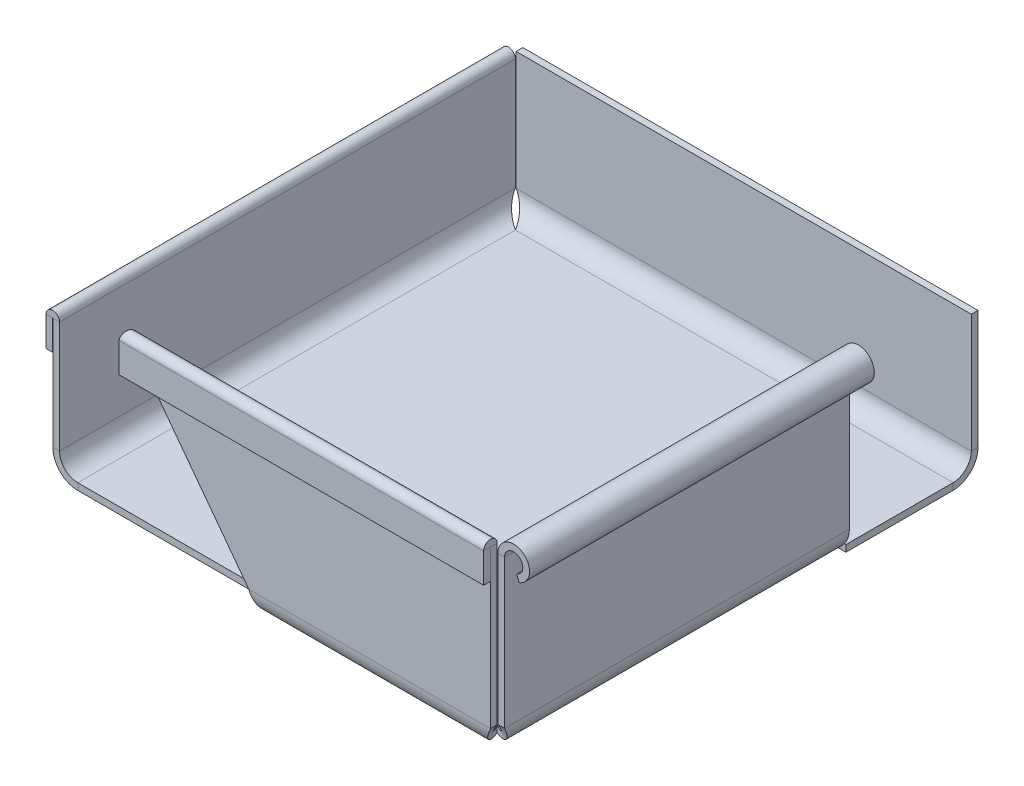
ISO-10303-21;
HEADER;
FILE_DESCRIPTION(('STEP AP214'),'2;1');
FILE_NAME('part.step','',(''),(''),'','','');
FILE_SCHEMA(('AUTOMOTIVE_DESIGN { 1 0 10303 214 1 1 1 1 }'));
ENDSEC;
DATA;
#1=APPLICATION_CONTEXT('core data for automotive mechanical design processes');
#2=APPLICATION_PROTOCOL_DEFINITION('international standard','automotive_design',2000,#1);
#3=PRODUCT_CONTEXT('',#1,'mechanical');
#4=PRODUCT('Part','Part','',(#3));
#5=PRODUCT_RELATED_PRODUCT_CATEGORY('part','',(#4));
#6=PRODUCT_DEFINITION_FORMATION('','',#4);
#7=PRODUCT_DEFINITION_CONTEXT('part definition',#1,'design');
#8=PRODUCT_DEFINITION('design','',#6,#7);
#9=PRODUCT_DEFINITION_SHAPE('','',#8);
#10=(LENGTH_UNIT() NAMED_UNIT(*) SI_UNIT(.MILLI.,.METRE.));
#11=(NAMED_UNIT(*) PLANE_ANGLE_UNIT() SI_UNIT($,.RADIAN.));
#12=(NAMED_UNIT(*) SI_UNIT($,.STERADIAN.) SOLID_ANGLE_UNIT());
#13=UNCERTAINTY_MEASURE_WITH_UNIT(LENGTH_MEASURE(1.E-05),#10,'distance_accuracy_value','');
#14=(GEOMETRIC_REPRESENTATION_CONTEXT(3) GLOBAL_UNCERTAINTY_ASSIGNED_CONTEXT((#13)) GLOBAL_UNIT_ASSIGNED_CONTEXT((#10,
#11,#12)) REPRESENTATION_CONTEXT('',''));
#15=CARTESIAN_POINT('',(0.,0.,0.));
#16=DIRECTION('',(0.,0.,1.));
#17=DIRECTION('',(1.,0.,0.));
#18=AXIS2_PLACEMENT_3D('',#15,#16,#17);
#19=CARTESIAN_POINT('',(0.,-0.736599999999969,50.));
#20=DIRECTION('',(0.,1.,0.));
#21=DIRECTION('',(0.,0.,1.));
#22=AXIS2_PLACEMENT_3D('',#19,#20,#21);
#23=PLANE('',#22);
#24=DIRECTION('',(1.,0.,0.));
#25=VECTOR('',#24,1.);
#26=CARTESIAN_POINT('',(1.99999999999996,-0.73659999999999,2.00000000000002));
#27=LINE('',#26,#25);
#28=CARTESIAN_POINT('',(1.99999999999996,-0.736599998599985,2.00000000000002));
#29=VERTEX_POINT('',#28);
#30=CARTESIAN_POINT('',(50.,-0.736599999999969,2.00000000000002));
#31=VERTEX_POINT('',#30);
#32=EDGE_CURVE('E473',#29,#31,#27,.T.);
#33=ORIENTED_EDGE('',*,*,#32,.T.);
#34=DIRECTION('',(0.,0.,-1.));
#35=VECTOR('',#34,1.);
#36=CARTESIAN_POINT('',(50.,-0.736599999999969,50.));
#37=LINE('',#36,#35);
#38=CARTESIAN_POINT('',(50.,-0.736599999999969,13.7427563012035));
#39=VERTEX_POINT('',#38);
#40=EDGE_CURVE('E476',#39,#31,#37,.T.);
#41=ORIENTED_EDGE('',*,*,#40,.F.);
#42=DIRECTION('',(1.,0.,0.));
#43=VECTOR('',#42,1.);
#44=CARTESIAN_POINT('',(0.,-0.736599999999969,13.7427563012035));
#45=LINE('',#44,#43);
#46=CARTESIAN_POINT('',(47.6317,-0.736599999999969,13.7427563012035));
#47=VERTEX_POINT('',#46);
#48=EDGE_CURVE('E1677',#47,#39,#45,.T.);
#49=ORIENTED_EDGE('',*,*,#48,.F.);
#50=DIRECTION('',(0.,0.,-1.));
#51=VECTOR('',#50,1.);
#52=CARTESIAN_POINT('',(47.6317,-0.736599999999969,50.));
#53=LINE('',#52,#51);
#54=CARTESIAN_POINT('',(47.6317,-0.736599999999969,14.1110563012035));
#55=VERTEX_POINT('',#54);
#56=EDGE_CURVE('E920',#55,#47,#53,.T.);
#57=ORIENTED_EDGE('',*,*,#56,.F.);
#58=DIRECTION('',(-1.,0.,0.));
#59=VECTOR('',#58,1.);
#60=CARTESIAN_POINT('',(0.,-0.736599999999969,14.1110563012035));
#61=LINE('',#60,#59);
#62=CARTESIAN_POINT('',(48.,-0.736599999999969,14.1110563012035));
#63=VERTEX_POINT('',#62);
#64=EDGE_CURVE('E918',#63,#55,#61,.T.);
#65=ORIENTED_EDGE('',*,*,#64,.F.);
#66=DIRECTION('',(0.,0.,1.));
#67=VECTOR('',#66,1.);
#68=CARTESIAN_POINT('',(48.,-0.736599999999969,14.1110563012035));
#69=LINE('',#68,#67);
#70=CARTESIAN_POINT('',(48.,-0.736599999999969,50.));
#71=VERTEX_POINT('',#70);
#72=EDGE_CURVE('E612',#63,#71,#69,.T.);
#73=ORIENTED_EDGE('',*,*,#72,.T.);
#74=DIRECTION('',(-1.,0.,0.));
#75=VECTOR('',#74,1.);
#76=CARTESIAN_POINT('',(50.,-0.736599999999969,50.));
#77=LINE('',#76,#75);
#78=CARTESIAN_POINT('',(25.,-0.736600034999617,50.));
#79=VERTEX_POINT('',#78);
#80=EDGE_CURVE('E45',#71,#79,#77,.T.);
#81=ORIENTED_EDGE('',*,*,#80,.T.);
#82=DIRECTION('',(1.,0.,0.));
#83=VECTOR('',#82,1.);
#84=CARTESIAN_POINT('',(0.,-0.736599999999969,50.));
#85=LINE('',#84,#83);
#86=CARTESIAN_POINT('',(1.99999999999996,-0.736599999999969,50.));
#87=VERTEX_POINT('',#86);
#88=EDGE_CURVE('E585',#87,#79,#85,.T.);
#89=ORIENTED_EDGE('',*,*,#88,.F.);
#90=DIRECTION('',(0.,0.,-1.));
#91=VECTOR('',#90,1.);
#92=CARTESIAN_POINT('',(1.99999999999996,-0.736599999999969,50.));
#93=LINE('',#92,#91);
#94=EDGE_CURVE('E479',#87,#29,#93,.T.);
#95=ORIENTED_EDGE('',*,*,#94,.T.);
#96=EDGE_LOOP('',(#33,#41,#49,#57,#65,#73,#81,#89,#95));
#97=FACE_BOUND('',#96,.T.);
#98=ADVANCED_FACE('F36',(#97),#23,.F.);
#99=CARTESIAN_POINT('',(0.,0.,50.));
#100=DIRECTION('',(0.,1.,0.));
#101=DIRECTION('',(0.,0.,1.));
#102=AXIS2_PLACEMENT_3D('',#99,#100,#101);
#103=PLANE('',#102);
#104=DIRECTION('',(0.,0.,-1.));
#105=VECTOR('',#104,1.);
#106=CARTESIAN_POINT('',(50.,0.,50.));
#107=LINE('',#106,#105);
#108=CARTESIAN_POINT('',(50.,0.,13.7427563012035));
#109=VERTEX_POINT('',#108);
#110=CARTESIAN_POINT('',(50.,1.39999817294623E-09,1.99999999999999));
#111=VERTEX_POINT('',#110);
#112=EDGE_CURVE('E584',#109,#111,#107,.T.);
#113=ORIENTED_EDGE('',*,*,#112,.T.);
#114=DIRECTION('',(1.,0.,0.));
#115=VECTOR('',#114,1.);
#116=CARTESIAN_POINT('',(1.99999999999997,0.,2.00000000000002));
#117=LINE('',#116,#115);
#118=CARTESIAN_POINT('',(1.99999999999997,1.40001898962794E-09,2.00000000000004));
#119=VERTEX_POINT('',#118);
#120=EDGE_CURVE('E490',#119,#111,#117,.T.);
#121=ORIENTED_EDGE('',*,*,#120,.F.);
#122=DIRECTION('',(0.,0.,-1.));
#123=VECTOR('',#122,1.);
#124=CARTESIAN_POINT('',(1.99999999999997,0.,50.));
#125=LINE('',#124,#123);
#126=CARTESIAN_POINT('',(1.99999999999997,7.00023372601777E-10,50.));
#127=VERTEX_POINT('',#126);
#128=EDGE_CURVE('E482',#127,#119,#125,.T.);
#129=ORIENTED_EDGE('',*,*,#128,.F.);
#130=DIRECTION('',(1.,0.,0.));
#131=VECTOR('',#130,1.);
#132=CARTESIAN_POINT('',(0.,0.,50.));
#133=LINE('',#132,#131);
#134=CARTESIAN_POINT('',(25.,-3.49996173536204E-08,50.));
#135=VERTEX_POINT('',#134);
#136=EDGE_CURVE('E575',#127,#135,#133,.T.);
#137=ORIENTED_EDGE('',*,*,#136,.T.);
#138=DIRECTION('',(-1.,0.,0.));
#139=VECTOR('',#138,1.);
#140=CARTESIAN_POINT('',(50.,0.,50.));
#141=LINE('',#140,#139);
#142=CARTESIAN_POINT('',(48.,-3.49996173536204E-08,50.));
#143=VERTEX_POINT('',#142);
#144=EDGE_CURVE('E629',#143,#135,#141,.T.);
#145=ORIENTED_EDGE('',*,*,#144,.F.);
#146=DIRECTION('',(0.,0.,1.));
#147=VECTOR('',#146,1.);
#148=CARTESIAN_POINT('',(48.,0.,14.1110563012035));
#149=LINE('',#148,#147);
#150=CARTESIAN_POINT('',(48.,0.,14.1110563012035));
#151=VERTEX_POINT('',#150);
#152=EDGE_CURVE('E608',#151,#143,#149,.T.);
#153=ORIENTED_EDGE('',*,*,#152,.F.);
#154=DIRECTION('',(1.,0.,0.));
#155=VECTOR('',#154,1.);
#156=CARTESIAN_POINT('',(47.6317,0.,14.1110563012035));
#157=LINE('',#156,#155);
#158=CARTESIAN_POINT('',(47.6317,0.,14.1110563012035));
#159=VERTEX_POINT('',#158);
#160=EDGE_CURVE('E925',#159,#151,#157,.T.);
#161=ORIENTED_EDGE('',*,*,#160,.F.);
#162=DIRECTION('',(0.,0.,1.));
#163=VECTOR('',#162,1.);
#164=CARTESIAN_POINT('',(47.6317,0.,13.7427563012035));
#165=LINE('',#164,#163);
#166=CARTESIAN_POINT('',(47.6317,0.,13.7427563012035));
#167=VERTEX_POINT('',#166);
#168=EDGE_CURVE('E1670',#167,#159,#165,.T.);
#169=ORIENTED_EDGE('',*,*,#168,.F.);
#170=DIRECTION('',(-1.,0.,0.));
#171=VECTOR('',#170,1.);
#172=CARTESIAN_POINT('',(50.,0.,13.7427563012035));
#173=LINE('',#172,#171);
#174=EDGE_CURVE('E922',#109,#167,#173,.T.);
#175=ORIENTED_EDGE('',*,*,#174,.F.);
#176=EDGE_LOOP('',(#113,#121,#129,#137,#145,#153,#161,#169,#175));
#177=FACE_BOUND('',#176,.T.);
#178=ADVANCED_FACE('F462',(#177),#103,.T.);
#179=CARTESIAN_POINT('',(50.,-0.736599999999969,50.));
#180=DIRECTION('',(0.,0.,-1.));
#181=DIRECTION('',(-1.,0.,0.));
#182=AXIS2_PLACEMENT_3D('',#179,#180,#181);
#183=PLANE('',#182);
#184=DIRECTION('',(0.,-1.,0.));
#185=VECTOR('',#184,1.);
#186=CARTESIAN_POINT('',(1.99999999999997,0.,50.));
#187=LINE('',#186,#185);
#188=EDGE_CURVE('E605',#127,#87,#187,.T.);
#189=ORIENTED_EDGE('',*,*,#188,.T.);
#190=ORIENTED_EDGE('',*,*,#88,.T.);
#191=CARTESIAN_POINT('',(25.,-3.49996173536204E-08,50.));
#192=CARTESIAN_POINT('',(25.,-0.736600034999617,50.));
#193=B_SPLINE_CURVE_WITH_KNOTS('',1,(#191,#192),.UNSPECIFIED.,.F.,.F.,(2,2),(0.,1.),.UNSPECIFIED.);
#194=EDGE_CURVE('E632',#135,#79,#193,.T.);
#195=ORIENTED_EDGE('',*,*,#194,.F.);
#196=ORIENTED_EDGE('',*,*,#136,.F.);
#197=EDGE_LOOP('',(#189,#190,#195,#196));
#198=FACE_BOUND('',#197,.T.);
#199=ADVANCED_FACE('F467',(#198),#183,.F.);
#200=CARTESIAN_POINT('',(50.,0.,50.));
#201=DIRECTION('',(1.,0.,0.));
#202=DIRECTION('',(0.,0.,-1.));
#203=AXIS2_PLACEMENT_3D('',#200,#201,#202);
#204=PLANE('',#203);
#205=DIRECTION('',(0.,-1.,0.));
#206=VECTOR('',#205,1.);
#207=CARTESIAN_POINT('',(50.,0.,2.00000000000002));
#208=LINE('',#207,#206);
#209=EDGE_CURVE('E483',#111,#31,#208,.T.);
#210=ORIENTED_EDGE('',*,*,#209,.F.);
#211=ORIENTED_EDGE('',*,*,#112,.F.);
#212=DIRECTION('',(0.,-1.,0.));
#213=VECTOR('',#212,1.);
#214=CARTESIAN_POINT('',(50.,0.,13.7427563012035));
#215=LINE('',#214,#213);
#216=EDGE_CURVE('E1669',#109,#39,#215,.T.);
#217=ORIENTED_EDGE('',*,*,#216,.T.);
#218=ORIENTED_EDGE('',*,*,#40,.T.);
#219=EDGE_LOOP('',(#210,#211,#217,#218));
#220=FACE_BOUND('',#219,.T.);
#221=ADVANCED_FACE('F563',(#220),#204,.T.);
#222=CARTESIAN_POINT('',(50.,0.,13.7427563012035));
#223=DIRECTION('',(0.,0.,1.));
#224=DIRECTION('',(1.,0.,0.));
#225=AXIS2_PLACEMENT_3D('',#222,#223,#224);
#226=PLANE('',#225);
#227=DIRECTION('',(0.,-1.,0.));
#228=VECTOR('',#227,1.);
#229=CARTESIAN_POINT('',(47.6317,0.,13.7427563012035));
#230=LINE('',#229,#228);
#231=EDGE_CURVE('E928',#167,#47,#230,.T.);
#232=ORIENTED_EDGE('',*,*,#231,.T.);
#233=ORIENTED_EDGE('',*,*,#48,.T.);
#234=ORIENTED_EDGE('',*,*,#216,.F.);
#235=ORIENTED_EDGE('',*,*,#174,.T.);
#236=EDGE_LOOP('',(#232,#233,#234,#235));
#237=FACE_BOUND('',#236,.T.);
#238=ADVANCED_FACE('F559',(#237),#226,.T.);
#239=CARTESIAN_POINT('',(47.6317,0.,13.7427563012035));
#240=DIRECTION('',(1.,0.,0.));
#241=DIRECTION('',(0.,0.,-1.));
#242=AXIS2_PLACEMENT_3D('',#239,#240,#241);
#243=PLANE('',#242);
#244=DIRECTION('',(0.,-1.,0.));
#245=VECTOR('',#244,1.);
#246=CARTESIAN_POINT('',(47.6317,0.,14.1110563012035));
#247=LINE('',#246,#245);
#248=EDGE_CURVE('E529',#159,#55,#247,.T.);
#249=ORIENTED_EDGE('',*,*,#248,.T.);
#250=ORIENTED_EDGE('',*,*,#56,.T.);
#251=ORIENTED_EDGE('',*,*,#231,.F.);
#252=ORIENTED_EDGE('',*,*,#168,.T.);
#253=EDGE_LOOP('',(#249,#250,#251,#252));
#254=FACE_BOUND('',#253,.T.);
#255=ADVANCED_FACE('F555',(#254),#243,.T.);
#256=CARTESIAN_POINT('',(47.6317,0.,14.1110563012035));
#257=DIRECTION('',(0.,0.,-1.));
#258=DIRECTION('',(0.,1.,0.));
#259=AXIS2_PLACEMENT_3D('',#256,#257,#258);
#260=PLANE('',#259);
#261=DIRECTION('',(0.,-1.,0.));
#262=VECTOR('',#261,1.);
#263=CARTESIAN_POINT('',(48.,0.,14.1110563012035));
#264=LINE('',#263,#262);
#265=EDGE_CURVE('E620',#151,#63,#264,.T.);
#266=ORIENTED_EDGE('',*,*,#265,.T.);
#267=ORIENTED_EDGE('',*,*,#64,.T.);
#268=ORIENTED_EDGE('',*,*,#248,.F.);
#269=ORIENTED_EDGE('',*,*,#160,.T.);
#270=EDGE_LOOP('',(#266,#267,#268,#269));
#271=FACE_BOUND('',#270,.T.);
#272=ADVANCED_FACE('F551',(#271),#260,.T.);
#273=CARTESIAN_POINT('',(50.,15.,-0.736600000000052));
#274=DIRECTION('',(0.,-1.,0.));
#275=DIRECTION('',(0.,0.,-1.));
#276=AXIS2_PLACEMENT_3D('',#273,#274,#275);
#277=PLANE('',#276);
#278=DIRECTION('',(1.,0.,0.));
#279=VECTOR('',#278,1.);
#280=CARTESIAN_POINT('',(50.,15.,0.));
#281=LINE('',#280,#279);
#282=CARTESIAN_POINT('',(0.0736599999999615,15.,0.));
#283=VERTEX_POINT('',#282);
#284=CARTESIAN_POINT('',(50.,15.,0.));
#285=VERTEX_POINT('',#284);
#286=EDGE_CURVE('E498',#283,#285,#281,.T.);
#287=ORIENTED_EDGE('',*,*,#286,.T.);
#288=DIRECTION('',(0.,0.,1.));
#289=VECTOR('',#288,1.);
#290=CARTESIAN_POINT('',(50.,15.,-0.736600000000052));
#291=LINE('',#290,#289);
#292=CARTESIAN_POINT('',(50.,15.,-0.736600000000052));
#293=VERTEX_POINT('',#292);
#294=EDGE_CURVE('E515',#293,#285,#291,.T.);
#295=ORIENTED_EDGE('',*,*,#294,.F.);
#296=DIRECTION('',(1.,0.,0.));
#297=VECTOR('',#296,1.);
#298=CARTESIAN_POINT('',(50.,15.,-0.736600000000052));
#299=LINE('',#298,#297);
#300=CARTESIAN_POINT('',(0.0736599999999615,15.,-0.736600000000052));
#301=VERTEX_POINT('',#300);
#302=EDGE_CURVE('E505',#301,#293,#299,.T.);
#303=ORIENTED_EDGE('',*,*,#302,.F.);
#304=DIRECTION('',(0.,0.,1.));
#305=VECTOR('',#304,1.);
#306=CARTESIAN_POINT('',(0.0736599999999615,15.,-0.736600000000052));
#307=LINE('',#306,#305);
#308=EDGE_CURVE('E516',#301,#283,#307,.T.);
#309=ORIENTED_EDGE('',*,*,#308,.T.);
#310=EDGE_LOOP('',(#287,#295,#303,#309));
#311=FACE_BOUND('',#310,.T.);
#312=ADVANCED_FACE('F554',(#311),#277,.F.);
#313=CARTESIAN_POINT('',(1.99999999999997,0.,0.));
#314=DIRECTION('',(0.,0.,1.));
#315=DIRECTION('',(0.,-1.,0.));
#316=AXIS2_PLACEMENT_3D('',#313,#314,#315);
#317=PLANE('',#316);
#318=ORIENTED_EDGE('',*,*,#286,.F.);
#319=DIRECTION('',(0.,1.,0.));
#320=VECTOR('',#319,1.);
#321=CARTESIAN_POINT('',(0.0736599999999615,15.,0.));
#322=LINE('',#321,#320);
#323=CARTESIAN_POINT('',(0.0736599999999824,1.99999999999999,1.39997909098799E-09));
#324=VERTEX_POINT('',#323);
#325=EDGE_CURVE('E509',#324,#283,#322,.T.);
#326=ORIENTED_EDGE('',*,*,#325,.F.);
#327=DIRECTION('',(-1.,0.,0.));
#328=VECTOR('',#327,1.);
#329=CARTESIAN_POINT('',(50.,2.00000000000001,0.));
#330=LINE('',#329,#328);
#331=CARTESIAN_POINT('',(50.,1.99999999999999,1.39997909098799E-09));
#332=VERTEX_POINT('',#331);
#333=EDGE_CURVE('E393',#332,#324,#330,.T.);
#334=ORIENTED_EDGE('',*,*,#333,.F.);
#335=DIRECTION('',(0.,-1.,0.));
#336=VECTOR('',#335,1.);
#337=CARTESIAN_POINT('',(50.,0.,0.));
#338=LINE('',#337,#336);
#339=EDGE_CURVE('E514',#285,#332,#338,.T.);
#340=ORIENTED_EDGE('',*,*,#339,.F.);
#341=EDGE_LOOP('',(#318,#326,#334,#340));
#342=FACE_BOUND('',#341,.T.);
#343=ADVANCED_FACE('F1542',(#342),#317,.T.);
#344=CARTESIAN_POINT('',(50.,0.,-0.7366));
#345=DIRECTION('',(-1.,0.,0.));
#346=DIRECTION('',(0.,0.,1.));
#347=AXIS2_PLACEMENT_3D('',#344,#345,#346);
#348=PLANE('',#347);
#349=DIRECTION('',(0.,0.,-1.));
#350=VECTOR('',#349,1.);
#351=CARTESIAN_POINT('',(50.,2.00000000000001,0.));
#352=LINE('',#351,#350);
#353=CARTESIAN_POINT('',(50.,1.99999999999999,-0.736600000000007));
#354=VERTEX_POINT('',#353);
#355=EDGE_CURVE('E511',#332,#354,#352,.T.);
#356=ORIENTED_EDGE('',*,*,#355,.T.);
#357=DIRECTION('',(0.,-1.,0.));
#358=VECTOR('',#357,1.);
#359=CARTESIAN_POINT('',(50.,0.,-0.7366));
#360=LINE('',#359,#358);
#361=EDGE_CURVE('E502',#293,#354,#360,.T.);
#362=ORIENTED_EDGE('',*,*,#361,.F.);
#363=ORIENTED_EDGE('',*,*,#294,.T.);
#364=ORIENTED_EDGE('',*,*,#339,.T.);
#365=EDGE_LOOP('',(#356,#362,#363,#364));
#366=FACE_BOUND('',#365,.T.);
#367=ADVANCED_FACE('F512',(#366),#348,.F.);
#368=CARTESIAN_POINT('',(1.99999999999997,0.,-0.7366));
#369=DIRECTION('',(0.,0.,1.));
#370=DIRECTION('',(0.,-1.,0.));
#371=AXIS2_PLACEMENT_3D('',#368,#369,#370);
#372=PLANE('',#371);
#373=DIRECTION('',(1.,0.,0.));
#374=VECTOR('',#373,1.);
#375=CARTESIAN_POINT('',(1.99999999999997,2.00000000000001,-0.736600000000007));
#376=LINE('',#375,#374);
#377=CARTESIAN_POINT('',(0.0736599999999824,1.99999999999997,-0.736599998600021));
#378=VERTEX_POINT('',#377);
#379=EDGE_CURVE('E493',#378,#354,#376,.T.);
#380=ORIENTED_EDGE('',*,*,#379,.F.);
#381=DIRECTION('',(0.,1.,0.));
#382=VECTOR('',#381,1.);
#383=CARTESIAN_POINT('',(0.0736599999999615,15.,-0.736600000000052));
#384=LINE('',#383,#382);
#385=EDGE_CURVE('E539',#378,#301,#384,.T.);
#386=ORIENTED_EDGE('',*,*,#385,.T.);
#387=ORIENTED_EDGE('',*,*,#302,.T.);
#388=ORIENTED_EDGE('',*,*,#361,.T.);
#389=EDGE_LOOP('',(#380,#386,#387,#388));
#390=FACE_BOUND('',#389,.T.);
#391=ADVANCED_FACE('F504',(#390),#372,.F.);
#392=CARTESIAN_POINT('',(0.0736599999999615,15.,-0.736600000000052));
#393=DIRECTION('',(1.,0.,0.));
#394=DIRECTION('',(0.,1.,0.));
#395=AXIS2_PLACEMENT_3D('',#392,#393,#394);
#396=PLANE('',#395);
#397=CARTESIAN_POINT('',(0.0736599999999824,2.00000000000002,0.00736600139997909));
#398=CARTESIAN_POINT('',(0.0736599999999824,2.00000000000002,1.39997909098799E-09));
#399=CARTESIAN_POINT('',(0.0736599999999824,2.00000000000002,-0.736599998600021));
#400=CARTESIAN_POINT('',(0.0736599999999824,2.00000000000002,-0.744039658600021));
#401=B_SPLINE_CURVE_WITH_KNOTS('',1,(#397,#398,#399,#400),.UNSPECIFIED.,.F.,.F.,(2,1,1,2),
(-0.0101,-9.9999999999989E-05,0.9999,1.01),.UNSPECIFIED.);
#402=EDGE_CURVE('E499',#324,#378,#401,.T.);
#403=ORIENTED_EDGE('',*,*,#402,.F.);
#404=ORIENTED_EDGE('',*,*,#325,.T.);
#405=ORIENTED_EDGE('',*,*,#308,.F.);
#406=ORIENTED_EDGE('',*,*,#385,.F.);
#407=EDGE_LOOP('',(#403,#404,#405,#406));
#408=FACE_BOUND('',#407,.T.);
#409=ADVANCED_FACE('F418',(#408),#396,.F.);
#410=CARTESIAN_POINT('',(0.0736599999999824,2.00000000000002,-0.744039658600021));
#411=CARTESIAN_POINT('',(0.234212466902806,1.64075206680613,-0.744039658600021));
#412=CARTESIAN_POINT('',(0.394716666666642,1.28175342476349,-0.672619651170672));
#413=CARTESIAN_POINT('',(0.715773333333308,0.618049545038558,-0.39770450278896));
#414=CARTESIAN_POINT('',(0.876301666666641,0.313659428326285,-0.194317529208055));
#415=CARTESIAN_POINT('',(1.19735833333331,-0.194317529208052,0.313659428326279));
#416=CARTESIAN_POINT('',(1.35788666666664,-0.397704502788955,0.618049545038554));
#417=CARTESIAN_POINT('',(1.67894333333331,-0.672619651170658,1.28175342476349));
#418=CARTESIAN_POINT('',(1.83944753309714,-0.744039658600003,1.64075206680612));
#419=CARTESIAN_POINT('',(1.99999999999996,-0.744039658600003,2.00000000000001));
#420=CARTESIAN_POINT('',(0.0736599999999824,2.00000000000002,-0.736599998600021));
#421=CARTESIAN_POINT('',(0.234212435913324,1.64172611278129,-0.736599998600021));
#422=CARTESIAN_POINT('',(0.394716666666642,1.28370074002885,-0.66537362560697));
#423=CARTESIAN_POINT('',(0.715773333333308,0.621796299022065,-0.391203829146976));
#424=CARTESIAN_POINT('',(0.876301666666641,0.318231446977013,-0.188368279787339));
#425=CARTESIAN_POINT('',(1.19735833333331,-0.188368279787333,0.318231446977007));
#426=CARTESIAN_POINT('',(1.35788666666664,-0.391203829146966,0.62179629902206));
#427=CARTESIAN_POINT('',(1.67894333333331,-0.665373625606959,1.28370074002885));
#428=CARTESIAN_POINT('',(1.83944756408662,-0.736599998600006,1.64172611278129));
#429=CARTESIAN_POINT('',(1.99999999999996,-0.736599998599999,2.00000000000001));
#430=CARTESIAN_POINT('',(0.0736599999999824,2.00000000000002,1.39997909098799E-09));
#431=CARTESIAN_POINT('',(0.234209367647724,1.73816630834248,1.39997915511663E-09));
#432=CARTESIAN_POINT('',(0.394716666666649,1.47650423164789,0.0520546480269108));
#433=CARTESIAN_POINT('',(0.715773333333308,0.99276203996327,0.252427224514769));
#434=CARTESIAN_POINT('',(0.876301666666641,0.770906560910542,0.400666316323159));
#435=CARTESIAN_POINT('',(1.19735833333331,0.40066631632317,0.770906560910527));
#436=CARTESIAN_POINT('',(1.35788666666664,0.252427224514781,0.992762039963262));
#437=CARTESIAN_POINT('',(1.6789433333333,0.0520546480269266,1.47650423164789));
#438=CARTESIAN_POINT('',(1.83945063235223,1.39999817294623E-09,1.73816630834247));
#439=CARTESIAN_POINT('',(1.99999999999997,1.39999817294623E-09,2.00000000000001));
#440=CARTESIAN_POINT('',(0.0736599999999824,2.00000000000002,0.00736600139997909));
#441=CARTESIAN_POINT('',(0.234209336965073,1.73913071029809,0.00736600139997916));
#442=CARTESIAN_POINT('',(0.394716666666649,1.47843226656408,0.0592289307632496));
#443=CARTESIAN_POINT('',(0.715773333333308,0.996471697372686,0.258863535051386));
#444=CARTESIAN_POINT('',(0.876301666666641,0.775433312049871,0.406556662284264));
#445=CARTESIAN_POINT('',(1.19735833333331,0.406556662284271,0.775433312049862));
#446=CARTESIAN_POINT('',(1.35788666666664,0.258863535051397,0.996471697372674));
#447=CARTESIAN_POINT('',(1.6789433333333,0.0592289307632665,1.47843226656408));
#448=CARTESIAN_POINT('',(1.83945066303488,0.00736600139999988,1.73913071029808));
#449=CARTESIAN_POINT('',(1.99999999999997,0.00736600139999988,2.00000000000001));
#450=B_SPLINE_SURFACE_WITH_KNOTS('',1,3,((#410,#411,#412,#413,#414,#415,#416,#417,#418,#419),
(#420,#421,#422,#423,#424,#425,#426,#427,#428,#429),(#430,#431,#432,#433,#434,#435,#436,#437,
#438,#439),(#440,#441,#442,#443,#444,#445,#446,#447,#448,#449)),.UNSPECIFIED.,.F.,.F.,.F.,(2,1,
1,2),(4,2,2,2,4),(-0.0101,0.,1.,1.01),(0.,0.25,0.5,0.75,1.),.UNSPECIFIED.);
#451=CARTESIAN_POINT('',(0.0736599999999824,2.00000000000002,-0.736599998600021));
#452=CARTESIAN_POINT('',(0.111471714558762,1.91562719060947,-0.736610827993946));
#453=CARTESIAN_POINT('',(0.149281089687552,1.83125821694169,-0.732698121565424));
#454=CARTESIAN_POINT('',(0.224896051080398,1.66324465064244,-0.717108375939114));
#455=CARTESIAN_POINT('',(0.262701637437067,1.57960001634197,-0.70543178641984));
#456=CARTESIAN_POINT('',(0.338283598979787,1.41380922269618,-0.674409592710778));
#457=CARTESIAN_POINT('',(0.376059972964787,1.33166190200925,-0.655070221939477));
#458=CARTESIAN_POINT('',(0.451605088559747,1.16952400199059,-0.608908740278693));
#459=CARTESIAN_POINT('',(0.489373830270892,1.0895333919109,-0.582086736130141));
#460=CARTESIAN_POINT('',(0.602741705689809,0.8536686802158,-0.490639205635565));
#461=CARTESIAN_POINT('',(0.678398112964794,0.701911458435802,-0.415034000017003));
#462=CARTESIAN_POINT('',(0.829642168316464,0.415023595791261,-0.237261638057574));
#463=CARTESIAN_POINT('',(0.905229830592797,0.279887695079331,-0.1351029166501));
#464=CARTESIAN_POINT('',(1.05641208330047,0.0306994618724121,0.0923129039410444));
#465=CARTESIAN_POINT('',(1.1320066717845,-0.0833554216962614,0.217567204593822));
#466=CARTESIAN_POINT('',(1.28323199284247,-0.286544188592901,0.486997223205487));
#467=CARTESIAN_POINT('',(1.3588627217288,-0.375663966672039,0.63118358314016));
#468=CARTESIAN_POINT('',(1.51016640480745,-0.52590566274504,0.933547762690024));
#469=CARTESIAN_POINT('',(1.58583935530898,-0.587009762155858,1.09173441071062));
#470=CARTESIAN_POINT('',(1.73709566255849,-0.678968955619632,1.41649260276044));
#471=CARTESIAN_POINT('',(1.81267892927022,-0.709879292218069,1.58304824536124));
#472=CARTESIAN_POINT('',(1.90681408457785,-0.729021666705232,1.79223421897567));
#473=CARTESIAN_POINT('',(1.92546578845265,-0.731864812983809,1.83376763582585));
#474=CARTESIAN_POINT('',(1.96274285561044,-0.735651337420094,1.91686240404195));
#475=CARTESIAN_POINT('',(1.98136821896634,-0.736597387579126,1.95842363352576));
#476=CARTESIAN_POINT('',(1.99999999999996,-0.736599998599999,2.00000000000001));
#477=B_SPLINE_CURVE_WITH_KNOTS('',3,(#451,#452,#453,#454,#455,#456,#457,#458,#459,#460,#461,
#462,#463,#464,#465,#466,#467,#468,#469,#470,#471,#472,#473,#474,#475,#476),.UNSPECIFIED.,.F.,
.F.,(4,2,2,2,2,2,2,2,2,2,2,2,4),(0.,0.277283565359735,0.554551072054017,0.831593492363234,
1.10863196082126,1.66274105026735,2.21667433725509,2.77054054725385,3.32471943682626,
3.87925030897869,4.43276469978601,4.5695956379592,4.7062337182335),.UNSPECIFIED.);
#478=EDGE_CURVE('E389',#378,#29,#477,.T.);
#479=CARTESIAN_POINT('',(1.99999999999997,1.40001898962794E-09,2.00000000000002));
#480=CARTESIAN_POINT('',(1.99999999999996,-0.736599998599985,2.00000000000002));
#481=B_SPLINE_CURVE_WITH_KNOTS('',1,(#479,#480),.UNSPECIFIED.,.F.,.F.,(2,2),(0.,1.),.UNSPECIFIED.);
#482=EDGE_CURVE('E399',#119,#29,#481,.T.);
#483=CARTESIAN_POINT('',(0.0736599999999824,2.00000000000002,1.39997909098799E-09));
#484=CARTESIAN_POINT('',(0.114151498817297,1.93396790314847,-1.05669596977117E-05));
#485=CARTESIAN_POINT('',(0.154640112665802,1.86793864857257,0.00327003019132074));
#486=CARTESIAN_POINT('',(0.235613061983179,1.73652962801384,0.0163336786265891));
#487=CARTESIAN_POINT('',(0.276097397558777,1.67114981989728,0.0261163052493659));
#488=CARTESIAN_POINT('',(0.357044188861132,1.54171368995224,0.0520963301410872));
#489=CARTESIAN_POINT('',(0.397506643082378,1.47765659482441,0.0682898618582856));
#490=CARTESIAN_POINT('',(0.478422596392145,1.35147303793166,0.106914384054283));
#491=CARTESIAN_POINT('',(0.518876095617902,1.28934654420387,0.129345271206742));
#492=CARTESIAN_POINT('',(0.640306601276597,1.10665080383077,0.2057546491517));
#493=CARTESIAN_POINT('',(0.721343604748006,0.989781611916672,0.268846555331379));
#494=CARTESIAN_POINT('',(0.883336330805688,0.770873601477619,0.416740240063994));
#495=CARTESIAN_POINT('',(0.964292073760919,0.668827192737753,0.501530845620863));
#496=CARTESIAN_POINT('',(1.12620448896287,0.483396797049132,0.689524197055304));
#497=CARTESIAN_POINT('',(1.20716116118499,0.400013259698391,0.792727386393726));
#498=CARTESIAN_POINT('',(1.36915495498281,0.255138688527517,1.01364742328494));
#499=CARTESIAN_POINT('',(1.45019209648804,0.193657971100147,1.13137107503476));
#500=CARTESIAN_POINT('',(1.57022417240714,0.120615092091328,1.31298192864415));
#501=CARTESIAN_POINT('',(1.60928285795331,0.0996819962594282,1.37321725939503));
#502=CARTESIAN_POINT('',(1.68740727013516,0.0636485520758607,1.49542625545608));
#503=CARTESIAN_POINT('',(1.72647299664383,0.0485481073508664,1.55739989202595));
#504=CARTESIAN_POINT('',(1.80461276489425,0.0243314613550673,1.68251780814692));
#505=CARTESIAN_POINT('',(1.84368680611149,0.0152168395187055,1.74566239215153));
#506=CARTESIAN_POINT('',(1.92183972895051,0.00304631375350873,1.87253705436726));
#507=CARTESIAN_POINT('',(1.9609186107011,-9.07406785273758E-06,1.93626718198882));
#508=CARTESIAN_POINT('',(1.99999999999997,1.39999817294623E-09,2.00000000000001));
#509=B_SPLINE_CURVE_WITH_KNOTS('',3,(#483,#484,#485,#486,#487,#488,#489,#490,#491,#492,#493,
#494,#495,#496,#497,#498,#499,#500,#501,#502,#503,#504,#505,#506,#507,#508),.UNSPECIFIED.,.F.,
.F.,(4,2,2,2,2,2,2,2,2,2,2,2,4),(0.,0.232298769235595,0.464582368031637,0.696726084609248,
0.928865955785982,1.39320323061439,1.8573018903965,2.32141172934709,2.7857398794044,
3.00987995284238,3.23401632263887,3.458211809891,3.68242639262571),.UNSPECIFIED.);
#510=EDGE_CURVE('E388',#324,#119,#509,.T.);
#511=ORIENTED_EDGE('',*,*,#402,.T.);
#512=ORIENTED_EDGE('',*,*,#478,.T.);
#513=ORIENTED_EDGE('',*,*,#482,.F.);
#514=ORIENTED_EDGE('',*,*,#510,.F.);
#515=EDGE_LOOP('',(#511,#512,#513,#514));
#516=FACE_BOUND('',#515,.T.);
#517=ADVANCED_FACE('F405',(#516),#450,.F.);
#518=CARTESIAN_POINT('',(50.,2.00000000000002,1.99999999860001));
#519=DIRECTION('',(-1.,0.,0.));
#520=DIRECTION('',(0.,0.,1.));
#521=AXIS2_PLACEMENT_3D('',#518,#519,#520);
#522=PLANE('',#521);
#523=CARTESIAN_POINT('',(50.,2.00000000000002,1.99999999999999));
#524=DIRECTION('',(1.,0.,0.));
#525=DIRECTION('',(0.,0.,-1.));
#526=AXIS2_PLACEMENT_3D('',#523,#524,#525);
#527=CIRCLE('',#526,2.73659999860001);
#528=EDGE_CURVE('E381',#31,#354,#527,.T.);
#529=ORIENTED_EDGE('',*,*,#528,.T.);
#530=ORIENTED_EDGE('',*,*,#355,.F.);
#531=CARTESIAN_POINT('',(50.,2.00000000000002,1.99999999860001));
#532=DIRECTION('',(1.,0.,0.));
#533=DIRECTION('',(0.,0.,-1.));
#534=AXIS2_PLACEMENT_3D('',#531,#532,#533);
#535=CIRCLE('',#534,1.99999999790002);
#536=EDGE_CURVE('E390',#111,#332,#535,.T.);
#537=ORIENTED_EDGE('',*,*,#536,.F.);
#538=ORIENTED_EDGE('',*,*,#209,.T.);
#539=EDGE_LOOP('',(#529,#530,#537,#538));
#540=FACE_BOUND('',#539,.T.);
#541=ADVANCED_FACE('F417',(#540),#522,.F.);
#542=CARTESIAN_POINT('',(-25.0333335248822,2.00000000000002,1.99999999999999));
#543=DIRECTION('',(1.,0.,0.));
#544=DIRECTION('',(0.,0.,-1.));
#545=AXIS2_PLACEMENT_3D('',#542,#543,#544);
#546=CYLINDRICAL_SURFACE('',#545,1.99999999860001);
#547=ORIENTED_EDGE('',*,*,#120,.T.);
#548=ORIENTED_EDGE('',*,*,#536,.T.);
#549=ORIENTED_EDGE('',*,*,#333,.T.);
#550=ORIENTED_EDGE('',*,*,#510,.T.);
#551=EDGE_LOOP('',(#547,#548,#549,#550));
#552=FACE_BOUND('',#551,.T.);
#553=ADVANCED_FACE('F419',(#552),#546,.F.);
#554=CARTESIAN_POINT('',(-25.0333335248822,2.00000000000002,1.99999999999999));
#555=DIRECTION('',(1.,0.,0.));
#556=DIRECTION('',(0.,0.,-1.));
#557=AXIS2_PLACEMENT_3D('',#554,#555,#556);
#558=CYLINDRICAL_SURFACE('',#557,2.73659999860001);
#559=ORIENTED_EDGE('',*,*,#32,.F.);
#560=ORIENTED_EDGE('',*,*,#478,.F.);
#561=ORIENTED_EDGE('',*,*,#379,.T.);
#562=ORIENTED_EDGE('',*,*,#528,.F.);
#563=EDGE_LOOP('',(#559,#560,#561,#562));
#564=FACE_BOUND('',#563,.T.);
#565=ADVANCED_FACE('F448',(#564),#558,.T.);
#566=CARTESIAN_POINT('',(1.99999999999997,1.99999999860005,50.));
#567=DIRECTION('',(0.,0.,-1.));
#568=DIRECTION('',(-1.,0.,0.));
#569=AXIS2_PLACEMENT_3D('',#566,#567,#568);
#570=PLANE('',#569);
#571=DIRECTION('',(-1.,0.,0.));
#572=VECTOR('',#571,1.);
#573=CARTESIAN_POINT('',(0.,2.,50.));
#574=LINE('',#573,#572);
#575=CARTESIAN_POINT('',(0.,2.00000000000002,50.));
#576=VERTEX_POINT('',#575);
#577=CARTESIAN_POINT('',(-0.736600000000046,1.99999999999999,50.));
#578=VERTEX_POINT('',#577);
#579=EDGE_CURVE('E308',#576,#578,#574,.T.);
#580=ORIENTED_EDGE('',*,*,#579,.T.);
#581=CARTESIAN_POINT('',(1.99999999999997,2.00000000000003,50.));
#582=DIRECTION('',(0.,0.,1.));
#583=DIRECTION('',(1.,0.,0.));
#584=AXIS2_PLACEMENT_3D('',#581,#582,#583);
#585=CIRCLE('',#584,2.73659999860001);
#586=EDGE_CURVE('E311',#578,#87,#585,.T.);
#587=ORIENTED_EDGE('',*,*,#586,.T.);
#588=ORIENTED_EDGE('',*,*,#188,.F.);
#589=CARTESIAN_POINT('',(1.99999999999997,1.99999999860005,50.));
#590=DIRECTION('',(0.,0.,1.));
#591=DIRECTION('',(1.,0.,0.));
#592=AXIS2_PLACEMENT_3D('',#589,#590,#591);
#593=CIRCLE('',#592,1.99999999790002);
#594=EDGE_CURVE('E314',#576,#127,#593,.T.);
#595=ORIENTED_EDGE('',*,*,#594,.F.);
#596=EDGE_LOOP('',(#580,#587,#588,#595));
#597=FACE_BOUND('',#596,.T.);
#598=ADVANCED_FACE('F344',(#597),#570,.F.);
#599=CARTESIAN_POINT('',(1.99999999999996,-0.736599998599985,2.00000000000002));
#600=CARTESIAN_POINT('',(1.64172680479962,-0.736599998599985,1.833308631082));
#601=CARTESIAN_POINT('',(1.28370074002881,-0.665373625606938,1.66666666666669));
#602=CARTESIAN_POINT('',(0.62179629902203,-0.391203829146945,1.33333333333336));
#603=CARTESIAN_POINT('',(0.318231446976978,-0.188368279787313,1.16666666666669));
#604=CARTESIAN_POINT('',(-0.188368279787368,0.318231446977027,0.833333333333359));
#605=CARTESIAN_POINT('',(-0.391203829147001,0.621796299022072,0.666666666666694));
#606=CARTESIAN_POINT('',(-0.665373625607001,1.28370074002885,0.333333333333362));
#607=CARTESIAN_POINT('',(-0.736599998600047,1.64172680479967,0.166691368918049));
#608=CARTESIAN_POINT('',(-0.736599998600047,2.00000000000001,0.));
#609=CARTESIAN_POINT('',(1.99999999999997,1.40001898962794E-09,2.00000000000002));
#610=CARTESIAN_POINT('',(1.7381670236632,1.40001898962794E-09,1.83331195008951));
#611=CARTESIAN_POINT('',(1.47650423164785,0.0520546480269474,1.66666666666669));
#612=CARTESIAN_POINT('',(0.992762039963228,0.252427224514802,1.33333333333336));
#613=CARTESIAN_POINT('',(0.770906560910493,0.400666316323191,1.16666666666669));
#614=CARTESIAN_POINT('',(0.400666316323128,0.770906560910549,0.833333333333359));
#615=CARTESIAN_POINT('',(0.25242722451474,0.992762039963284,0.666666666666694));
#616=CARTESIAN_POINT('',(0.0520546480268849,1.4765042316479,0.333333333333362));
#617=CARTESIAN_POINT('',(1.3999565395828E-09,1.73816702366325,0.166688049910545));
#618=CARTESIAN_POINT('',(1.3999496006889E-09,2.00000000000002,0.));
#619=B_SPLINE_SURFACE_WITH_KNOTS('',1,3,((#599,#600,#601,#602,#603,#604,#605,#606,#607,#608),
(#609,#610,#611,#612,#613,#614,#615,#616,#617,#618)),.UNSPECIFIED.,.F.,.F.,.F.,(2,2),(4,2,2,2,
4),(0.,1.),(0.,0.25,0.5,0.75,1.),.UNSPECIFIED.);
#620=CARTESIAN_POINT('',(1.99999999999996,-0.736599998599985,2.00000000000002));
#621=CARTESIAN_POINT('',(1.64172680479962,-0.736599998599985,1.833308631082));
#622=CARTESIAN_POINT('',(1.28370074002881,-0.665373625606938,1.66666666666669));
#623=CARTESIAN_POINT('',(0.62179629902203,-0.391203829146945,1.33333333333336));
#624=CARTESIAN_POINT('',(0.318231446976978,-0.188368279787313,1.16666666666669));
#625=CARTESIAN_POINT('',(-0.188368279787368,0.318231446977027,0.833333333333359));
#626=CARTESIAN_POINT('',(-0.391203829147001,0.621796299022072,0.666666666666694));
#627=CARTESIAN_POINT('',(-0.665373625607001,1.28370074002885,0.333333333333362));
#628=CARTESIAN_POINT('',(-0.736599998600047,1.64172680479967,0.166691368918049));
#629=CARTESIAN_POINT('',(-0.736599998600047,2.00000000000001,0.));
#630=B_SPLINE_CURVE_WITH_KNOTS('',3,(#620,#621,#622,#623,#624,#625,#626,#627,#628,#629),
.UNSPECIFIED.,.F.,.F.,(4,2,2,2,4),(0.,0.25,0.5,0.75,1.),.UNSPECIFIED.);
#631=CARTESIAN_POINT('',(-0.736600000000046,1.99999999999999,0.));
#632=VERTEX_POINT('',#631);
#633=EDGE_CURVE('E313',#29,#632,#630,.T.);
#634=CARTESIAN_POINT('',(-0.736599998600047,2.00000000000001,0.));
#635=CARTESIAN_POINT('',(1.3999496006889E-09,2.00000000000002,0.));
#636=B_SPLINE_CURVE_WITH_KNOTS('',1,(#634,#635),.UNSPECIFIED.,.F.,.F.,(2,2),(0.,1.),.UNSPECIFIED.);
#637=CARTESIAN_POINT('',(1.3999496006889E-09,2.00000000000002,0.));
#638=VERTEX_POINT('',#637);
#639=EDGE_CURVE('E304',#638,#632,#636,.F.);
#640=CARTESIAN_POINT('',(1.3999496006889E-09,2.00000000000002,0.));
#641=CARTESIAN_POINT('',(1.3999565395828E-09,1.73816702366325,0.166688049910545));
#642=CARTESIAN_POINT('',(0.0520546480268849,1.4765042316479,0.333333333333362));
#643=CARTESIAN_POINT('',(0.25242722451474,0.992762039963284,0.666666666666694));
#644=CARTESIAN_POINT('',(0.400666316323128,0.770906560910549,0.833333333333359));
#645=CARTESIAN_POINT('',(0.770906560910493,0.400666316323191,1.16666666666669));
#646=CARTESIAN_POINT('',(0.992762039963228,0.252427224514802,1.33333333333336));
#647=CARTESIAN_POINT('',(1.47650423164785,0.0520546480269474,1.66666666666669));
#648=CARTESIAN_POINT('',(1.7381670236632,1.40001898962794E-09,1.83331195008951));
#649=CARTESIAN_POINT('',(1.99999999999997,1.40001898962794E-09,2.00000000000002));
#650=B_SPLINE_CURVE_WITH_KNOTS('',3,(#640,#641,#642,#643,#644,#645,#646,#647,#648,#649),
.UNSPECIFIED.,.F.,.F.,(4,2,2,2,4),(0.,0.25,0.5,0.75,1.),.UNSPECIFIED.);
#651=EDGE_CURVE('E317',#119,#638,#650,.F.);
#652=ORIENTED_EDGE('',*,*,#482,.T.);
#653=ORIENTED_EDGE('',*,*,#633,.T.);
#654=ORIENTED_EDGE('',*,*,#639,.F.);
#655=ORIENTED_EDGE('',*,*,#651,.F.);
#656=EDGE_LOOP('',(#652,#653,#654,#655));
#657=FACE_BOUND('',#656,.T.);
#658=ADVANCED_FACE('F335',(#657),#619,.F.);
#659=CARTESIAN_POINT('',(1.99999999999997,2.00000000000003,-24.1439257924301));
#660=DIRECTION('',(0.,0.,1.));
#661=DIRECTION('',(1.,0.,0.));
#662=AXIS2_PLACEMENT_3D('',#659,#660,#661);
#663=CYLINDRICAL_SURFACE('',#662,1.99999999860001);
#664=ORIENTED_EDGE('',*,*,#651,.T.);
#665=DIRECTION('',(0.,0.,1.));
#666=VECTOR('',#665,1.);
#667=CARTESIAN_POINT('',(0.,2.,0.));
#668=LINE('',#667,#666);
#669=EDGE_CURVE('E310',#638,#576,#668,.T.);
#670=ORIENTED_EDGE('',*,*,#669,.T.);
#671=ORIENTED_EDGE('',*,*,#594,.T.);
#672=ORIENTED_EDGE('',*,*,#128,.T.);
#673=EDGE_LOOP('',(#664,#670,#671,#672));
#674=FACE_BOUND('',#673,.T.);
#675=ADVANCED_FACE('F324',(#674),#663,.F.);
#676=CARTESIAN_POINT('',(1.99999999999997,2.00000000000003,-24.1439257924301));
#677=DIRECTION('',(0.,0.,1.));
#678=DIRECTION('',(1.,0.,0.));
#679=AXIS2_PLACEMENT_3D('',#676,#677,#678);
#680=CYLINDRICAL_SURFACE('',#679,2.73659999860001);
#681=ORIENTED_EDGE('',*,*,#633,.F.);
#682=ORIENTED_EDGE('',*,*,#94,.F.);
#683=ORIENTED_EDGE('',*,*,#586,.F.);
#684=DIRECTION('',(0.,0.,-1.));
#685=VECTOR('',#684,1.);
#686=CARTESIAN_POINT('',(-0.736600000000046,1.99999999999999,50.));
#687=LINE('',#686,#685);
#688=EDGE_CURVE('E300',#578,#632,#687,.T.);
#689=ORIENTED_EDGE('',*,*,#688,.T.);
#690=EDGE_LOOP('',(#681,#682,#683,#689));
#691=FACE_BOUND('',#690,.T.);
#692=ADVANCED_FACE('F334',(#691),#680,.T.);
#693=CARTESIAN_POINT('',(0.,0.,50.));
#694=DIRECTION('',(1.,0.,0.));
#695=DIRECTION('',(0.,1.,0.));
#696=AXIS2_PLACEMENT_3D('',#693,#694,#695);
#697=PLANE('',#696);
#698=DIRECTION('',(0.,0.,-1.));
#699=VECTOR('',#698,1.);
#700=CARTESIAN_POINT('',(0.,14.2584000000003,0.));
#701=LINE('',#700,#699);
#702=CARTESIAN_POINT('',(0.,14.2584000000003,0.));
#703=VERTEX_POINT('',#702);
#704=CARTESIAN_POINT('',(0.,14.2584000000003,50.));
#705=VERTEX_POINT('',#704);
#706=EDGE_CURVE('E1694',#703,#705,#701,.F.);
#707=ORIENTED_EDGE('',*,*,#706,.T.);
#708=DIRECTION('',(0.,1.,0.));
#709=VECTOR('',#708,1.);
#710=CARTESIAN_POINT('',(0.,15.,50.));
#711=LINE('',#710,#709);
#712=EDGE_CURVE('E294',#576,#705,#711,.T.);
#713=ORIENTED_EDGE('',*,*,#712,.F.);
#714=ORIENTED_EDGE('',*,*,#669,.F.);
#715=DIRECTION('',(0.,-1.,0.));
#716=VECTOR('',#715,1.);
#717=CARTESIAN_POINT('',(0.,0.,0.));
#718=LINE('',#717,#716);
#719=EDGE_CURVE('E39',#703,#638,#718,.T.);
#720=ORIENTED_EDGE('',*,*,#719,.F.);
#721=EDGE_LOOP('',(#707,#713,#714,#720));
#722=FACE_BOUND('',#721,.T.);
#723=ADVANCED_FACE('F744',(#722),#697,.T.);
#724=CARTESIAN_POINT('',(-0.736600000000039,0.,0.));
#725=DIRECTION('',(0.,0.,1.));
#726=DIRECTION('',(1.,0.,0.));
#727=AXIS2_PLACEMENT_3D('',#724,#725,#726);
#728=PLANE('',#727);
#729=DIRECTION('',(0.,-1.,0.));
#730=VECTOR('',#729,1.);
#731=CARTESIAN_POINT('',(-0.736600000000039,0.,0.));
#732=LINE('',#731,#730);
#733=CARTESIAN_POINT('',(-0.736600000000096,14.2584,0.));
#734=VERTEX_POINT('',#733);
#735=EDGE_CURVE('E302',#734,#632,#732,.T.);
#736=ORIENTED_EDGE('',*,*,#735,.F.);
#737=DIRECTION('',(1.,3.4694469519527E-13,0.));
#738=VECTOR('',#737,1.);
#739=CARTESIAN_POINT('',(-0.736600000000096,14.2584,0.));
#740=LINE('',#739,#738);
#741=EDGE_CURVE('E296',#734,#703,#740,.T.);
#742=ORIENTED_EDGE('',*,*,#741,.T.);
#743=ORIENTED_EDGE('',*,*,#719,.T.);
#744=ORIENTED_EDGE('',*,*,#639,.T.);
#745=EDGE_LOOP('',(#736,#742,#743,#744));
#746=FACE_BOUND('',#745,.T.);
#747=ADVANCED_FACE('F747',(#746),#728,.F.);
#748=CARTESIAN_POINT('',(-0.736600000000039,0.,50.));
#749=DIRECTION('',(1.,0.,0.));
#750=DIRECTION('',(0.,1.,0.));
#751=AXIS2_PLACEMENT_3D('',#748,#749,#750);
#752=PLANE('',#751);
#753=DIRECTION('',(0.,1.,0.));
#754=VECTOR('',#753,1.);
#755=CARTESIAN_POINT('',(-0.736600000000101,15.,50.));
#756=LINE('',#755,#754);
#757=CARTESIAN_POINT('',(-0.736600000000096,14.2584,50.));
#758=VERTEX_POINT('',#757);
#759=EDGE_CURVE('E292',#578,#758,#756,.T.);
#760=ORIENTED_EDGE('',*,*,#759,.T.);
#761=DIRECTION('',(0.,0.,-1.));
#762=VECTOR('',#761,1.);
#763=CARTESIAN_POINT('',(-0.736600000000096,14.2584,0.));
#764=LINE('',#763,#762);
#765=EDGE_CURVE('E265',#734,#758,#764,.F.);
#766=ORIENTED_EDGE('',*,*,#765,.F.);
#767=ORIENTED_EDGE('',*,*,#735,.T.);
#768=ORIENTED_EDGE('',*,*,#688,.F.);
#769=EDGE_LOOP('',(#760,#766,#767,#768));
#770=FACE_BOUND('',#769,.T.);
#771=ADVANCED_FACE('F298',(#770),#752,.F.);
#772=CARTESIAN_POINT('',(-0.736600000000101,15.,50.));
#773=DIRECTION('',(0.,0.,-1.));
#774=DIRECTION('',(-1.,0.,0.));
#775=AXIS2_PLACEMENT_3D('',#772,#773,#774);
#776=PLANE('',#775);
#777=ORIENTED_EDGE('',*,*,#712,.T.);
#778=DIRECTION('',(1.,3.4694469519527E-13,0.));
#779=VECTOR('',#778,1.);
#780=CARTESIAN_POINT('',(-0.736600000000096,14.2584,50.));
#781=LINE('',#780,#779);
#782=EDGE_CURVE('E282',#758,#705,#781,.T.);
#783=ORIENTED_EDGE('',*,*,#782,.F.);
#784=ORIENTED_EDGE('',*,*,#759,.F.);
#785=ORIENTED_EDGE('',*,*,#579,.F.);
#786=EDGE_LOOP('',(#777,#783,#784,#785));
#787=FACE_BOUND('',#786,.T.);
#788=ADVANCED_FACE('F290',(#787),#776,.F.);
#789=CARTESIAN_POINT('',(50.,0.,14.1110563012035));
#790=DIRECTION('',(1.,0.,0.));
#791=DIRECTION('',(0.,1.,0.));
#792=AXIS2_PLACEMENT_3D('',#789,#790,#791);
#793=PLANE('',#792);
#794=DIRECTION('',(0.,-1.,0.));
#795=VECTOR('',#794,1.);
#796=CARTESIAN_POINT('',(50.,0.,51.92634));
#797=LINE('',#796,#795);
#798=CARTESIAN_POINT('',(50.0000000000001,18.2634,51.92634));
#799=VERTEX_POINT('',#798);
#800=CARTESIAN_POINT('',(49.9999999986,2.00000000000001,51.92634));
#801=VERTEX_POINT('',#800);
#802=EDGE_CURVE('E712',#799,#801,#797,.T.);
#803=ORIENTED_EDGE('',*,*,#802,.F.);
#804=DIRECTION('',(0.,0.,1.));
#805=VECTOR('',#804,1.);
#806=CARTESIAN_POINT('',(50.0000000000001,18.2634,51.92634));
#807=LINE('',#806,#805);
#808=CARTESIAN_POINT('',(50.0000000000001,18.2634,14.1110563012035));
#809=VERTEX_POINT('',#808);
#810=EDGE_CURVE('E911',#799,#809,#807,.F.);
#811=ORIENTED_EDGE('',*,*,#810,.T.);
#812=DIRECTION('',(0.,1.,0.));
#813=VECTOR('',#812,1.);
#814=CARTESIAN_POINT('',(50.,0.,14.1110563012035));
#815=LINE('',#814,#813);
#816=CARTESIAN_POINT('',(49.9999999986,2.00000000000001,14.1110563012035));
#817=VERTEX_POINT('',#816);
#818=EDGE_CURVE('E686',#817,#809,#815,.T.);
#819=ORIENTED_EDGE('',*,*,#818,.F.);
#820=DIRECTION('',(0.,0.,-1.));
#821=VECTOR('',#820,1.);
#822=CARTESIAN_POINT('',(50.,2.00000000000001,50.));
#823=LINE('',#822,#821);
#824=EDGE_CURVE('E699',#801,#817,#823,.T.);
#825=ORIENTED_EDGE('',*,*,#824,.F.);
#826=EDGE_LOOP('',(#803,#811,#819,#825));
#827=FACE_BOUND('',#826,.T.);
#828=ADVANCED_FACE('F667',(#827),#793,.F.);
#829=CARTESIAN_POINT('',(50.7366,0.,51.92634));
#830=DIRECTION('',(0.,0.,-1.));
#831=DIRECTION('',(-1.,0.,0.));
#832=AXIS2_PLACEMENT_3D('',#829,#830,#831);
#833=PLANE('',#832);
#834=DIRECTION('',(0.,-1.,0.));
#835=VECTOR('',#834,1.);
#836=CARTESIAN_POINT('',(50.7366,0.,51.92634));
#837=LINE('',#836,#835);
#838=CARTESIAN_POINT('',(50.7366000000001,18.2634,51.92634));
#839=VERTEX_POINT('',#838);
#840=CARTESIAN_POINT('',(50.7366,2.00000000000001,51.92634));
#841=VERTEX_POINT('',#840);
#842=EDGE_CURVE('E702',#839,#841,#837,.T.);
#843=ORIENTED_EDGE('',*,*,#842,.F.);
#844=DIRECTION('',(-1.,0.,0.));
#845=VECTOR('',#844,1.);
#846=CARTESIAN_POINT('',(50.7366000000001,18.2634,51.92634));
#847=LINE('',#846,#845);
#848=EDGE_CURVE('E1792',#839,#799,#847,.T.);
#849=ORIENTED_EDGE('',*,*,#848,.T.);
#850=ORIENTED_EDGE('',*,*,#802,.T.);
#851=CARTESIAN_POINT('',(50.7439659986,2.00000000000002,51.92634));
#852=CARTESIAN_POINT('',(50.7365999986,2.00000000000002,51.92634));
#853=CARTESIAN_POINT('',(49.9999999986,2.00000000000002,51.92634));
#854=CARTESIAN_POINT('',(49.9925603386,2.00000000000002,51.92634));
#855=B_SPLINE_CURVE_WITH_KNOTS('',1,(#851,#852,#853,#854),.UNSPECIFIED.,.F.,.F.,(2,1,1,2),
(-0.01,0.,1.,1.0101),.UNSPECIFIED.);
#856=EDGE_CURVE('E698',#801,#841,#855,.F.);
#857=ORIENTED_EDGE('',*,*,#856,.T.);
#858=EDGE_LOOP('',(#843,#849,#850,#857));
#859=FACE_BOUND('',#858,.T.);
#860=ADVANCED_FACE('F727',(#859),#833,.F.);
#861=CARTESIAN_POINT('',(50.7366,0.,14.1110563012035));
#862=DIRECTION('',(1.,0.,0.));
#863=DIRECTION('',(0.,1.,0.));
#864=AXIS2_PLACEMENT_3D('',#861,#862,#863);
#865=PLANE('',#864);
#866=DIRECTION('',(0.,0.,1.));
#867=VECTOR('',#866,1.);
#868=CARTESIAN_POINT('',(50.7366000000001,18.2634,51.92634));
#869=LINE('',#868,#867);
#870=CARTESIAN_POINT('',(50.7366000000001,18.2634,14.1110563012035));
#871=VERTEX_POINT('',#870);
#872=EDGE_CURVE('E1779',#839,#871,#869,.F.);
#873=ORIENTED_EDGE('',*,*,#872,.F.);
#874=ORIENTED_EDGE('',*,*,#842,.T.);
#875=DIRECTION('',(0.,0.,-1.));
#876=VECTOR('',#875,1.);
#877=CARTESIAN_POINT('',(50.7366,2.00000000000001,14.1110563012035));
#878=LINE('',#877,#876);
#879=CARTESIAN_POINT('',(50.7365999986,2.00000000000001,14.1110563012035));
#880=VERTEX_POINT('',#879);
#881=EDGE_CURVE('E695',#841,#880,#878,.T.);
#882=ORIENTED_EDGE('',*,*,#881,.T.);
#883=DIRECTION('',(0.,1.,0.));
#884=VECTOR('',#883,1.);
#885=CARTESIAN_POINT('',(50.7366,0.,14.1110563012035));
#886=LINE('',#885,#884);
#887=EDGE_CURVE('E693',#880,#871,#886,.T.);
#888=ORIENTED_EDGE('',*,*,#887,.T.);
#889=EDGE_LOOP('',(#873,#874,#882,#888));
#890=FACE_BOUND('',#889,.T.);
#891=ADVANCED_FACE('F736',(#890),#865,.T.);
#892=CARTESIAN_POINT('',(50.7366,0.,14.1110563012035));
#893=DIRECTION('',(0.,0.,1.));
#894=DIRECTION('',(1.,0.,0.));
#895=AXIS2_PLACEMENT_3D('',#892,#893,#894);
#896=PLANE('',#895);
#897=ORIENTED_EDGE('',*,*,#818,.T.);
#898=DIRECTION('',(-1.,0.,0.));
#899=VECTOR('',#898,1.);
#900=CARTESIAN_POINT('',(50.7366000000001,18.2634,14.1110563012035));
#901=LINE('',#900,#899);
#902=EDGE_CURVE('E60',#871,#809,#901,.T.);
#903=ORIENTED_EDGE('',*,*,#902,.F.);
#904=ORIENTED_EDGE('',*,*,#887,.F.);
#905=DIRECTION('',(1.,0.,0.));
#906=VECTOR('',#905,1.);
#907=CARTESIAN_POINT('',(50.,2.00000000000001,14.1110563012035));
#908=LINE('',#907,#906);
#909=EDGE_CURVE('E696',#817,#880,#908,.T.);
#910=ORIENTED_EDGE('',*,*,#909,.F.);
#911=EDGE_LOOP('',(#897,#903,#904,#910));
#912=FACE_BOUND('',#911,.T.);
#913=ADVANCED_FACE('F740',(#912),#896,.F.);
#914=CARTESIAN_POINT('',(48.0000000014,2.00000000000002,14.1110563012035));
#915=DIRECTION('',(0.,0.,1.));
#916=DIRECTION('',(1.,0.,0.));
#917=AXIS2_PLACEMENT_3D('',#914,#915,#916);
#918=PLANE('',#917);
#919=ORIENTED_EDGE('',*,*,#909,.T.);
#920=CARTESIAN_POINT('',(48.,2.00000000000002,14.1110563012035));
#921=DIRECTION('',(0.,0.,1.));
#922=DIRECTION('',(1.,0.,0.));
#923=AXIS2_PLACEMENT_3D('',#920,#921,#922);
#924=CIRCLE('',#923,2.73659999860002);
#925=EDGE_CURVE('E643',#880,#63,#924,.F.);
#926=ORIENTED_EDGE('',*,*,#925,.T.);
#927=ORIENTED_EDGE('',*,*,#265,.F.);
#928=CARTESIAN_POINT('',(48.0000000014,2.00000000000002,14.1110563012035));
#929=DIRECTION('',(0.,0.,-1.));
#930=DIRECTION('',(-1.,0.,0.));
#931=AXIS2_PLACEMENT_3D('',#928,#929,#930);
#932=CIRCLE('',#931,1.99999999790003);
#933=EDGE_CURVE('E642',#817,#151,#932,.T.);
#934=ORIENTED_EDGE('',*,*,#933,.F.);
#935=EDGE_LOOP('',(#919,#926,#927,#934));
#936=FACE_BOUND('',#935,.T.);
#937=ADVANCED_FACE('F665',(#936),#918,.F.);
#938=CARTESIAN_POINT('',(48.,-0.7439659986,50.));
#939=CARTESIAN_POINT('',(48.3592382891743,-0.7439659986,50.160552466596));
#940=CARTESIAN_POINT('',(48.7182272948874,-0.672547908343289,50.3210566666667));
#941=CARTESIAN_POINT('',(49.3819133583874,-0.397640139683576,50.6421133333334));
#942=CARTESIAN_POINT('',(49.6862953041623,-0.194258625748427,50.8026416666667));
#943=CARTESIAN_POINT('',(50.1942586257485,0.313704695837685,51.1236983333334));
#944=CARTESIAN_POINT('',(50.3976401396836,0.618086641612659,51.2842266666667));
#945=CARTESIAN_POINT('',(50.6725479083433,1.28177270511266,51.6052833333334));
#946=CARTESIAN_POINT('',(50.7439659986,1.64076171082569,51.765787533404));
#947=CARTESIAN_POINT('',(50.7439659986,2.00000000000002,51.92634));
#948=CARTESIAN_POINT('',(48.,-0.7365999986,50.));
#949=CARTESIAN_POINT('',(48.3582738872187,-0.7365999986,50.1605524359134));
#950=CARTESIAN_POINT('',(48.7162992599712,-0.66537362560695,50.3210566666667));
#951=CARTESIAN_POINT('',(49.3782037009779,-0.391203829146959,50.6421133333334));
#952=CARTESIAN_POINT('',(49.681768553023,-0.188368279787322,50.8026416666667));
#953=CARTESIAN_POINT('',(50.1883682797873,0.31823144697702,51.1236983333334));
#954=CARTESIAN_POINT('',(50.391203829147,0.621796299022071,51.2842266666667));
#955=CARTESIAN_POINT('',(50.665373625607,1.28370074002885,51.6052833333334));
#956=CARTESIAN_POINT('',(50.7365999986,1.6417261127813,51.7657875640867));
#957=CARTESIAN_POINT('',(50.7365999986,2.00000000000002,51.92634));
#958=CARTESIAN_POINT('',(48.,1.40000034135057E-09,50.));
#959=CARTESIAN_POINT('',(48.2618336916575,1.40000029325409E-09,50.1605493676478));
#960=CARTESIAN_POINT('',(48.5234957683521,0.0520546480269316,50.3210566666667));
#961=CARTESIAN_POINT('',(49.0072379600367,0.252427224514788,50.6421133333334));
#962=CARTESIAN_POINT('',(49.2290934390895,0.400666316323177,50.8026416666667));
#963=CARTESIAN_POINT('',(49.5993336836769,0.770906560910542,51.1236983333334));
#964=CARTESIAN_POINT('',(49.7475727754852,0.992762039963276,51.2842266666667));
#965=CARTESIAN_POINT('',(49.9479453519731,1.4765042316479,51.6052833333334));
#966=CARTESIAN_POINT('',(49.9999999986,1.73816630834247,51.7657906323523));
#967=CARTESIAN_POINT('',(49.9999999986,2.00000000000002,51.92634));
#968=CARTESIAN_POINT('',(48.,0.00743966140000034,50.));
#969=CARTESIAN_POINT('',(48.2608596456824,0.00743966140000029,50.1605493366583));
#970=CARTESIAN_POINT('',(48.5215484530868,0.0593006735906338,50.3210566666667));
#971=CARTESIAN_POINT('',(49.0034912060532,0.258927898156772,50.6421133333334));
#972=CARTESIAN_POINT('',(49.2245214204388,0.406615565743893,50.8026416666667));
#973=CARTESIAN_POINT('',(49.5933844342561,0.775478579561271,51.1236983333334));
#974=CARTESIAN_POINT('',(49.7410721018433,0.996508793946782,51.2842266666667));
#975=CARTESIAN_POINT('',(49.9406993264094,1.47845154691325,51.6052833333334));
#976=CARTESIAN_POINT('',(49.9925603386,1.73914035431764,51.7657906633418));
#977=CARTESIAN_POINT('',(49.9925603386,2.00000000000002,51.92634));
#978=B_SPLINE_SURFACE_WITH_KNOTS('',1,3,((#938,#939,#940,#941,#942,#943,#944,#945,#946,#947),
(#948,#949,#950,#951,#952,#953,#954,#955,#956,#957),(#958,#959,#960,#961,#962,#963,#964,#965,
#966,#967),(#968,#969,#970,#971,#972,#973,#974,#975,#976,#977)),.UNSPECIFIED.,.F.,.F.,.F.,(2,1,
1,2),(4,2,2,2,4),(-0.01,0.,1.,1.0101),(0.,0.25,0.5,0.75,1.),.UNSPECIFIED.);
#979=CARTESIAN_POINT('',(48.,-0.7365999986,50.));
#980=CARTESIAN_POINT('',(48.0843722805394,-0.736610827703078,50.0378114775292));
#981=CARTESIAN_POINT('',(48.1687407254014,-0.732698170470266,50.0756206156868));
#982=CARTESIAN_POINT('',(48.3367532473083,-0.717108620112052,50.15123510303));
#983=CARTESIAN_POINT('',(48.4203973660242,-0.705432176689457,50.1890404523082));
#984=CARTESIAN_POINT('',(48.586187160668,-0.674410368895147,50.2646219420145));
#985=CARTESIAN_POINT('',(48.6683339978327,-0.655071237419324,50.3023980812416));
#986=CARTESIAN_POINT('',(48.8304709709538,-0.608910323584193,50.3779427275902));
#987=CARTESIAN_POINT('',(48.9104611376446,-0.582088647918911,50.4157112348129));
#988=CARTESIAN_POINT('',(49.146325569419,-0.490641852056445,50.5290788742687));
#989=CARTESIAN_POINT('',(49.2980829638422,-0.415036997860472,50.6047352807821));
#990=CARTESIAN_POINT('',(49.5849712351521,-0.237265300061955,50.7559793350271));
#991=CARTESIAN_POINT('',(49.7201073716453,-0.135106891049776,50.8315669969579));
#992=CARTESIAN_POINT('',(49.9692961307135,0.0923083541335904,50.9827492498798));
#993=CARTESIAN_POINT('',(50.0833513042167,0.217562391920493,51.0583438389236));
#994=CARTESIAN_POINT('',(50.286540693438,0.486991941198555,51.209569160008));
#995=CARTESIAN_POINT('',(50.3756608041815,0.631178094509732,51.2851998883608));
#996=CARTESIAN_POINT('',(50.5259031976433,0.933541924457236,51.4365035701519));
#997=CARTESIAN_POINT('',(50.5870076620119,1.09172842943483,51.5121765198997));
#998=CARTESIAN_POINT('',(50.6789676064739,1.41648640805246,51.6634328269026));
#999=CARTESIAN_POINT('',(50.7098783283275,1.58304198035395,51.7390160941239));
#1000=CARTESIAN_POINT('',(50.7290212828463,1.79222896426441,51.8331517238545));
#1001=CARTESIAN_POINT('',(50.7318645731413,1.83376342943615,51.8518039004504));
#1002=CARTESIAN_POINT('',(50.7356512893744,1.91686029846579,51.8890819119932));
#1003=CARTESIAN_POINT('',(50.7365973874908,1.95842258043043,51.9077077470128));
#1004=CARTESIAN_POINT('',(50.7365999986,2.00000000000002,51.92634));
#1005=B_SPLINE_CURVE_WITH_KNOTS('',3,(#979,#980,#981,#982,#983,#984,#985,#986,#987,#988,#989,
#990,#991,#992,#993,#994,#995,#996,#997,#998,#999,#1000,#1001,#1002,#1003,#1004),.UNSPECIFIED.,
.F.,.F.,(4,2,2,2,2,2,2,2,2,2,2,2,4),(0.,0.277281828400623,0.554547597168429,0.831588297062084,
1.10862504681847,1.66273412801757,2.21666741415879,2.77053362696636,3.32471251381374,
3.87924337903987,4.43275777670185,4.56959218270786,4.7062337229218),.UNSPECIFIED.);
#1006=EDGE_CURVE('E639',#71,#841,#1005,.T.);
#1007=CARTESIAN_POINT('',(48.,1.40000034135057E-09,50.));
#1008=CARTESIAN_POINT('',(48.0660332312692,-1.05677379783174E-05,50.0404921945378));
#1009=CARTESIAN_POINT('',(48.1320636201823,0.00327014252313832,50.0809815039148));
#1010=CARTESIAN_POINT('',(48.2634748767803,0.0163342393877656,50.1619558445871));
#1011=CARTESIAN_POINT('',(48.3288557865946,0.0261172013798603,50.2024408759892));
#1012=CARTESIAN_POINT('',(48.4582940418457,0.0520981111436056,50.2833890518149));
#1013=CARTESIAN_POINT('',(48.5223521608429,0.0682921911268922,50.3238521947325));
#1014=CARTESIAN_POINT('',(48.6485376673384,0.106918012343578,50.4047695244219));
#1015=CARTESIAN_POINT('',(48.7106650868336,0.129349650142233,50.4452237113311));
#1016=CARTESIAN_POINT('',(48.8933613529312,0.205760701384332,50.5666549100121));
#1017=CARTESIAN_POINT('',(49.0102301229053,0.268853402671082,50.6476919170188));
#1018=CARTESIAN_POINT('',(49.229137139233,0.416748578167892,50.8096846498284));
#1019=CARTESIAN_POINT('',(49.3311829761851,0.501539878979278,50.8906403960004));
#1020=CARTESIAN_POINT('',(49.5166121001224,0.689534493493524,51.0525528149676));
#1021=CARTESIAN_POINT('',(49.5999949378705,0.792738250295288,51.133509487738));
#1022=CARTESIAN_POINT('',(49.744868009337,1.01365927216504,51.2955032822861));
#1023=CARTESIAN_POINT('',(49.8063479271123,1.13138334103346,51.3765404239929));
#1024=CARTESIAN_POINT('',(49.8793891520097,1.31299364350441,51.4965718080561));
#1025=CARTESIAN_POINT('',(49.9003215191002,1.37322803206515,51.5356298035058));
#1026=CARTESIAN_POINT('',(49.9363537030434,1.49543505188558,51.6137528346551));
#1027=CARTESIAN_POINT('',(49.9514536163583,1.55740765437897,51.6528178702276));
#1028=CARTESIAN_POINT('',(49.9756694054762,1.68252343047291,51.7309562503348));
#1029=CARTESIAN_POINT('',(49.9847837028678,1.74566690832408,51.7700295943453));
#1030=CARTESIAN_POINT('',(49.9969537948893,1.87253932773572,51.8481811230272));
#1031=CARTESIAN_POINT('',(50.0000090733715,1.93626831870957,51.8872593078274));
#1032=CARTESIAN_POINT('',(49.9999999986,2.00000000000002,51.92634));
#1033=B_SPLINE_CURVE_WITH_KNOTS('',3,(#1007,#1008,#1009,#1010,#1011,#1012,#1013,#1014,#1015,
#1016,#1017,#1018,#1019,#1020,#1021,#1022,#1023,#1024,#1025,#1026,#1027,#1028,#1029,#1030,#1031,
#1032),.UNSPECIFIED.,.F.,.F.,(4,2,2,2,2,2,2,2,2,2,2,2,4),(0.,0.232302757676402,
0.464590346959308,0.696738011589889,0.92888182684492,1.39321912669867,1.85731780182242,
2.32142764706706,2.78575579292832,3.00989190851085,3.23402431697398,3.45821580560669,
3.68242639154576),.UNSPECIFIED.);
#1034=EDGE_CURVE('E651',#143,#801,#1033,.T.);
#1035=CARTESIAN_POINT('',(48.,0.00743966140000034,50.));
#1036=CARTESIAN_POINT('',(48.,1.40000034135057E-09,50.));
#1037=CARTESIAN_POINT('',(48.,-0.7365999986,50.));
#1038=CARTESIAN_POINT('',(48.,-0.7439659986,50.));
#1039=B_SPLINE_CURVE_WITH_KNOTS('',1,(#1035,#1036,#1037,#1038),.UNSPECIFIED.,.F.,.F.,(2,1,1,2),
(-0.01,9.9999999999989E-05,1.0001,1.0101),.UNSPECIFIED.);
#1040=EDGE_CURVE('E11',#143,#71,#1039,.T.);
#1041=ORIENTED_EDGE('',*,*,#1006,.T.);
#1042=ORIENTED_EDGE('',*,*,#856,.F.);
#1043=ORIENTED_EDGE('',*,*,#1034,.F.);
#1044=ORIENTED_EDGE('',*,*,#1040,.T.);
#1045=EDGE_LOOP('',(#1041,#1042,#1043,#1044));
#1046=FACE_BOUND('',#1045,.T.);
#1047=ADVANCED_FACE('F657',(#1046),#978,.F.);
#1048=CARTESIAN_POINT('',(48.,2.00000000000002,-4.9862690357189));
#1049=DIRECTION('',(0.,0.,1.));
#1050=DIRECTION('',(1.,0.,0.));
#1051=AXIS2_PLACEMENT_3D('',#1048,#1049,#1050);
#1052=CYLINDRICAL_SURFACE('',#1051,1.99999999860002);
#1053=ORIENTED_EDGE('',*,*,#152,.T.);
#1054=ORIENTED_EDGE('',*,*,#1034,.T.);
#1055=ORIENTED_EDGE('',*,*,#824,.T.);
#1056=ORIENTED_EDGE('',*,*,#933,.T.);
#1057=EDGE_LOOP('',(#1053,#1054,#1055,#1056));
#1058=FACE_BOUND('',#1057,.T.);
#1059=ADVANCED_FACE('F664',(#1058),#1052,.F.);
#1060=CARTESIAN_POINT('',(48.,2.00000000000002,-4.9862690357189));
#1061=DIRECTION('',(0.,0.,1.));
#1062=DIRECTION('',(1.,0.,0.));
#1063=AXIS2_PLACEMENT_3D('',#1060,#1061,#1062);
#1064=CYLINDRICAL_SURFACE('',#1063,2.73659999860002);
#1065=ORIENTED_EDGE('',*,*,#72,.F.);
#1066=ORIENTED_EDGE('',*,*,#925,.F.);
#1067=ORIENTED_EDGE('',*,*,#881,.F.);
#1068=ORIENTED_EDGE('',*,*,#1006,.F.);
#1069=EDGE_LOOP('',(#1065,#1066,#1067,#1068));
#1070=FACE_BOUND('',#1069,.T.);
#1071=ADVANCED_FACE('F653',(#1070),#1064,.T.);
#1072=CARTESIAN_POINT('',(25.,-0.736600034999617,50.));
#1073=CARTESIAN_POINT('',(24.874979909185,-0.736600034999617,50.3582776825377));
#1074=CARTESIAN_POINT('',(24.75,-0.665373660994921,50.7162992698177));
#1075=CARTESIAN_POINT('',(24.5,-0.391203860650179,51.3782037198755));
#1076=CARTESIAN_POINT('',(24.375,-0.188368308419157,51.6817685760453));
#1077=CARTESIAN_POINT('',(24.125,0.318231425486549,52.1883683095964));
#1078=CARTESIAN_POINT('',(24.,0.621796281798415,52.391203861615));
#1079=CARTESIAN_POINT('',(23.75,1.28370073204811,52.6653736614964));
#1080=CARTESIAN_POINT('',(23.6250200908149,1.641722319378,52.7366000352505));
#1081=CARTESIAN_POINT('',(23.5,2.00000000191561,52.7366000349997));
#1082=CARTESIAN_POINT('',(25.,-3.49996173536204E-08,50.));
#1083=CARTESIAN_POINT('',(24.8749816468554,-3.49996173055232E-08,50.2618378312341));
#1084=CARTESIAN_POINT('',(24.75,0.0520546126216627,50.5234957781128));
#1085=CARTESIAN_POINT('',(24.5,0.252427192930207,51.0072379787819));
#1086=CARTESIAN_POINT('',(24.375,0.400666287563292,51.229093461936));
#1087=CARTESIAN_POINT('',(24.125,0.770906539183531,51.5993337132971));
#1088=CARTESIAN_POINT('',(24.,0.992762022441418,51.7475728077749));
#1089=CARTESIAN_POINT('',(23.75,1.47650422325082,51.9479453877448));
#1090=CARTESIAN_POINT('',(23.6250183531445,1.73816217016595,52.000000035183));
#1091=CARTESIAN_POINT('',(23.5,2.0000000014,52.0000000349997));
#1092=B_SPLINE_SURFACE_WITH_KNOTS('',1,3,((#1072,#1073,#1074,#1075,#1076,#1077,#1078,#1079,
#1080,#1081),(#1082,#1083,#1084,#1085,#1086,#1087,#1088,#1089,#1090,#1091)),.UNSPECIFIED.,.F.,
.F.,.F.,(2,2),(4,2,2,2,4),(0.,1.),(0.,0.25,0.5,0.75,1.),.UNSPECIFIED.);
#1093=CARTESIAN_POINT('',(25.,-0.736600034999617,50.));
#1094=CARTESIAN_POINT('',(24.874979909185,-0.736600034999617,50.3582776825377));
#1095=CARTESIAN_POINT('',(24.75,-0.665373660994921,50.7162992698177));
#1096=CARTESIAN_POINT('',(24.5,-0.391203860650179,51.3782037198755));
#1097=CARTESIAN_POINT('',(24.375,-0.188368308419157,51.6817685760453));
#1098=CARTESIAN_POINT('',(24.125,0.318231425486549,52.1883683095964));
#1099=CARTESIAN_POINT('',(24.,0.621796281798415,52.391203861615));
#1100=CARTESIAN_POINT('',(23.75,1.28370073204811,52.6653736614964));
#1101=CARTESIAN_POINT('',(23.6250200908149,1.641722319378,52.7366000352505));
#1102=CARTESIAN_POINT('',(23.5,2.00000000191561,52.7366000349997));
#1103=B_SPLINE_CURVE_WITH_KNOTS('',3,(#1093,#1094,#1095,#1096,#1097,#1098,#1099,#1100,#1101,
#1102),.UNSPECIFIED.,.F.,.F.,(4,2,2,2,4),(0.,0.25,0.5,0.75,1.),.UNSPECIFIED.);
#1104=CARTESIAN_POINT('',(23.5,2.00000000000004,52.7366));
#1105=VERTEX_POINT('',#1104);
#1106=EDGE_CURVE('E826',#79,#1105,#1103,.T.);
#1107=CARTESIAN_POINT('',(23.5,2.00000000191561,52.7366000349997));
#1108=CARTESIAN_POINT('',(23.5,2.0000000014,52.0000000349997));
#1109=B_SPLINE_CURVE_WITH_KNOTS('',1,(#1107,#1108),.UNSPECIFIED.,.F.,.F.,(2,2),(0.,1.),.UNSPECIFIED.);
#1110=CARTESIAN_POINT('',(23.5,2.00000000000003,52.));
#1111=VERTEX_POINT('',#1110);
#1112=EDGE_CURVE('E769',#1111,#1105,#1109,.F.);
#1113=CARTESIAN_POINT('',(23.5,2.0000000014,52.0000000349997));
#1114=CARTESIAN_POINT('',(23.6250183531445,1.73816217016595,52.000000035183));
#1115=CARTESIAN_POINT('',(23.75,1.47650422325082,51.9479453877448));
#1116=CARTESIAN_POINT('',(24.,0.992762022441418,51.7475728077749));
#1117=CARTESIAN_POINT('',(24.125,0.770906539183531,51.5993337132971));
#1118=CARTESIAN_POINT('',(24.375,0.400666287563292,51.229093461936));
#1119=CARTESIAN_POINT('',(24.5,0.252427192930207,51.0072379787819));
#1120=CARTESIAN_POINT('',(24.75,0.0520546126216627,50.5234957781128));
#1121=CARTESIAN_POINT('',(24.8749816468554,-3.49996173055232E-08,50.2618378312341));
#1122=CARTESIAN_POINT('',(25.,-3.49996173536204E-08,50.));
#1123=B_SPLINE_CURVE_WITH_KNOTS('',3,(#1113,#1114,#1115,#1116,#1117,#1118,#1119,#1120,#1121,
#1122),.UNSPECIFIED.,.F.,.F.,(4,2,2,2,4),(0.,0.25,0.5,0.75,1.),.UNSPECIFIED.);
#1124=EDGE_CURVE('E820',#135,#1111,#1123,.F.);
#1125=ORIENTED_EDGE('',*,*,#194,.T.);
#1126=ORIENTED_EDGE('',*,*,#1106,.T.);
#1127=ORIENTED_EDGE('',*,*,#1112,.F.);
#1128=ORIENTED_EDGE('',*,*,#1124,.F.);
#1129=EDGE_LOOP('',(#1125,#1126,#1127,#1128));
#1130=FACE_BOUND('',#1129,.T.);
#1131=ADVANCED_FACE('F842',(#1130),#1092,.F.);
#1132=CARTESIAN_POINT('',(50.,2.00000000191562,52.7366000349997));
#1133=CARTESIAN_POINT('',(49.8333086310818,1.64172680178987,52.7366000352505));
#1134=CARTESIAN_POINT('',(49.6666666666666,1.28370073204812,52.6653736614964));
#1135=CARTESIAN_POINT('',(49.3333333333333,0.621796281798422,52.391203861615));
#1136=CARTESIAN_POINT('',(49.1666666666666,0.318231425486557,52.1883683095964));
#1137=CARTESIAN_POINT('',(48.8333333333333,-0.188368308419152,51.6817685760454));
#1138=CARTESIAN_POINT('',(48.6666666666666,-0.391203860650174,51.3782037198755));
#1139=CARTESIAN_POINT('',(48.3333333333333,-0.665373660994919,50.7162992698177));
#1140=CARTESIAN_POINT('',(48.1666913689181,-0.736600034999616,50.3582732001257));
#1141=CARTESIAN_POINT('',(48.,-0.736600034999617,50.));
#1142=CARTESIAN_POINT('',(50.,2.00000000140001,52.0000000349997));
#1143=CARTESIAN_POINT('',(49.8333119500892,1.73816702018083,52.000000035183));
#1144=CARTESIAN_POINT('',(49.6666666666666,1.47650422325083,51.9479453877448));
#1145=CARTESIAN_POINT('',(49.3333333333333,0.992762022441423,51.7475728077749));
#1146=CARTESIAN_POINT('',(49.1666666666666,0.770906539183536,51.5993337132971));
#1147=CARTESIAN_POINT('',(48.8333333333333,0.400666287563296,51.229093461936));
#1148=CARTESIAN_POINT('',(48.6666666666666,0.25242719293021,51.0072379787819));
#1149=CARTESIAN_POINT('',(48.3333333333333,0.0520546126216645,50.5234957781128));
#1150=CARTESIAN_POINT('',(48.1666880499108,-3.49996163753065E-08,50.2618329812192));
#1151=CARTESIAN_POINT('',(48.,-3.49996173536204E-08,50.));
#1152=B_SPLINE_SURFACE_WITH_KNOTS('',1,3,((#1132,#1133,#1134,#1135,#1136,#1137,#1138,#1139,
#1140,#1141),(#1142,#1143,#1144,#1145,#1146,#1147,#1148,#1149,#1150,#1151)),.UNSPECIFIED.,.F.,
.F.,.F.,(2,2),(4,2,2,2,4),(0.,1.),(0.,0.25,0.5,0.75,1.),.UNSPECIFIED.);
#1153=CARTESIAN_POINT('',(50.,2.00000000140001,52.0000000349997));
#1154=CARTESIAN_POINT('',(50.,2.00000000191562,52.7366000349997));
#1155=B_SPLINE_CURVE_WITH_KNOTS('',1,(#1153,#1154),.UNSPECIFIED.,.F.,.F.,(2,2),(0.,1.),.UNSPECIFIED.);
#1156=CARTESIAN_POINT('',(50.,2.00000000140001,52.0000000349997));
#1157=VERTEX_POINT('',#1156);
#1158=CARTESIAN_POINT('',(50.,2.00000000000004,52.7366));
#1159=VERTEX_POINT('',#1158);
#1160=EDGE_CURVE('E777',#1157,#1159,#1155,.T.);
#1161=CARTESIAN_POINT('',(50.,2.00000000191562,52.7366000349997));
#1162=CARTESIAN_POINT('',(49.8333086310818,1.64172680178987,52.7366000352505));
#1163=CARTESIAN_POINT('',(49.6666666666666,1.28370073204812,52.6653736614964));
#1164=CARTESIAN_POINT('',(49.3333333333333,0.621796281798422,52.391203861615));
#1165=CARTESIAN_POINT('',(49.1666666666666,0.318231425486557,52.1883683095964));
#1166=CARTESIAN_POINT('',(48.8333333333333,-0.188368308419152,51.6817685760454));
#1167=CARTESIAN_POINT('',(48.6666666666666,-0.391203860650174,51.3782037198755));
#1168=CARTESIAN_POINT('',(48.3333333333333,-0.665373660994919,50.7162992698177));
#1169=CARTESIAN_POINT('',(48.1666913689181,-0.736600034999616,50.3582732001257));
#1170=CARTESIAN_POINT('',(48.,-0.736600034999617,50.));
#1171=B_SPLINE_CURVE_WITH_KNOTS('',3,(#1161,#1162,#1163,#1164,#1165,#1166,#1167,#1168,#1169,
#1170),.UNSPECIFIED.,.F.,.F.,(4,2,2,2,4),(0.,0.25,0.5,0.75,1.),.UNSPECIFIED.);
#1172=EDGE_CURVE('E938',#1159,#71,#1171,.T.);
#1173=CARTESIAN_POINT('',(48.,-3.49996173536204E-08,50.));
#1174=CARTESIAN_POINT('',(48.1666880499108,-3.49996163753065E-08,50.2618329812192));
#1175=CARTESIAN_POINT('',(48.3333333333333,0.0520546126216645,50.5234957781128));
#1176=CARTESIAN_POINT('',(48.6666666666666,0.25242719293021,51.0072379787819));
#1177=CARTESIAN_POINT('',(48.8333333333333,0.400666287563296,51.229093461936));
#1178=CARTESIAN_POINT('',(49.1666666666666,0.770906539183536,51.5993337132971));
#1179=CARTESIAN_POINT('',(49.3333333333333,0.992762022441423,51.7475728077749));
#1180=CARTESIAN_POINT('',(49.6666666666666,1.47650422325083,51.9479453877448));
#1181=CARTESIAN_POINT('',(49.8333119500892,1.73816702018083,52.000000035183));
#1182=CARTESIAN_POINT('',(50.,2.00000000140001,52.0000000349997));
#1183=B_SPLINE_CURVE_WITH_KNOTS('',3,(#1173,#1174,#1175,#1176,#1177,#1178,#1179,#1180,#1181,
#1182),.UNSPECIFIED.,.F.,.F.,(4,2,2,2,4),(0.,0.25,0.5,0.75,1.),.UNSPECIFIED.);
#1184=EDGE_CURVE('E897',#1157,#143,#1183,.F.);
#1185=ORIENTED_EDGE('',*,*,#1160,.T.);
#1186=ORIENTED_EDGE('',*,*,#1172,.T.);
#1187=ORIENTED_EDGE('',*,*,#1040,.F.);
#1188=ORIENTED_EDGE('',*,*,#1184,.F.);
#1189=EDGE_LOOP('',(#1185,#1186,#1187,#1188));
#1190=FACE_BOUND('',#1189,.T.);
#1191=ADVANCED_FACE('F798',(#1190),#1152,.F.);
#1192=CARTESIAN_POINT('',(9.72509639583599,2.00000000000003,50.));
#1193=DIRECTION('',(1.,0.,0.));
#1194=DIRECTION('',(0.,0.,-1.));
#1195=AXIS2_PLACEMENT_3D('',#1192,#1193,#1194);
#1196=CYLINDRICAL_SURFACE('',#1195,2.00000003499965);
#1197=ORIENTED_EDGE('',*,*,#1184,.T.);
#1198=ORIENTED_EDGE('',*,*,#144,.T.);
#1199=ORIENTED_EDGE('',*,*,#1124,.T.);
#1200=DIRECTION('',(1.,0.,0.));
#1201=VECTOR('',#1200,1.);
#1202=CARTESIAN_POINT('',(23.5,2.00000000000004,52.));
#1203=LINE('',#1202,#1201);
#1204=EDGE_CURVE('E774',#1111,#1157,#1203,.T.);
#1205=ORIENTED_EDGE('',*,*,#1204,.T.);
#1206=EDGE_LOOP('',(#1197,#1198,#1199,#1205));
#1207=FACE_BOUND('',#1206,.T.);
#1208=ADVANCED_FACE('F787',(#1207),#1196,.F.);
#1209=CARTESIAN_POINT('',(9.72509639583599,2.00000000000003,50.));
#1210=DIRECTION('',(1.,0.,0.));
#1211=DIRECTION('',(0.,0.,-1.));
#1212=AXIS2_PLACEMENT_3D('',#1209,#1210,#1211);
#1213=CYLINDRICAL_SURFACE('',#1212,2.73660003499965);
#1214=ORIENTED_EDGE('',*,*,#1172,.F.);
#1215=DIRECTION('',(1.,0.,0.));
#1216=VECTOR('',#1215,1.);
#1217=CARTESIAN_POINT('',(50.,2.00000000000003,52.7366));
#1218=LINE('',#1217,#1216);
#1219=EDGE_CURVE('E946',#1105,#1159,#1218,.T.);
#1220=ORIENTED_EDGE('',*,*,#1219,.F.);
#1221=ORIENTED_EDGE('',*,*,#1106,.F.);
#1222=ORIENTED_EDGE('',*,*,#80,.F.);
#1223=EDGE_LOOP('',(#1214,#1220,#1221,#1222));
#1224=FACE_BOUND('',#1223,.T.);
#1225=ADVANCED_FACE('F797',(#1224),#1213,.T.);
#1226=CARTESIAN_POINT('',(50.,0.,52.));
#1227=DIRECTION('',(0.,0.,1.));
#1228=DIRECTION('',(1.,0.,0.));
#1229=AXIS2_PLACEMENT_3D('',#1226,#1227,#1228);
#1230=PLANE('',#1229);
#1231=DIRECTION('',(0.6,-0.8,0.));
#1232=VECTOR('',#1231,1.);
#1233=CARTESIAN_POINT('',(25.,0.,52.));
#1234=LINE('',#1233,#1232);
#1235=CARTESIAN_POINT('',(10.5562,19.2584,52.));
#1236=VERTEX_POINT('',#1235);
#1237=EDGE_CURVE('E767',#1236,#1111,#1234,.T.);
#1238=ORIENTED_EDGE('',*,*,#1237,.F.);
#1239=DIRECTION('',(-1.,0.,0.));
#1240=VECTOR('',#1239,1.);
#1241=CARTESIAN_POINT('',(9.99999999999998,19.2584,52.));
#1242=LINE('',#1241,#1240);
#1243=CARTESIAN_POINT('',(50.,19.2584,52.));
#1244=VERTEX_POINT('',#1243);
#1245=EDGE_CURVE('E962',#1236,#1244,#1242,.F.);
#1246=ORIENTED_EDGE('',*,*,#1245,.T.);
#1247=DIRECTION('',(0.,1.,0.));
#1248=VECTOR('',#1247,1.);
#1249=CARTESIAN_POINT('',(50.,20.,52.));
#1250=LINE('',#1249,#1248);
#1251=EDGE_CURVE('E941',#1157,#1244,#1250,.T.);
#1252=ORIENTED_EDGE('',*,*,#1251,.F.);
#1253=ORIENTED_EDGE('',*,*,#1204,.F.);
#1254=EDGE_LOOP('',(#1238,#1246,#1252,#1253));
#1255=FACE_BOUND('',#1254,.T.);
#1256=ADVANCED_FACE('F960',(#1255),#1230,.F.);
#1257=CARTESIAN_POINT('',(25.,0.,52.7366));
#1258=DIRECTION('',(0.8,0.6,0.));
#1259=DIRECTION('',(-0.6,0.8,0.));
#1260=AXIS2_PLACEMENT_3D('',#1257,#1258,#1259);
#1261=PLANE('',#1260);
#1262=DIRECTION('',(-0.6,0.8,0.));
#1263=VECTOR('',#1262,1.);
#1264=CARTESIAN_POINT('',(34.,-12.,52.7366));
#1265=LINE('',#1264,#1263);
#1266=CARTESIAN_POINT('',(10.5562,19.2584,52.7366));
#1267=VERTEX_POINT('',#1266);
#1268=EDGE_CURVE('E718',#1267,#1105,#1265,.F.);
#1269=ORIENTED_EDGE('',*,*,#1268,.F.);
#1270=DIRECTION('',(0.,0.,-1.));
#1271=VECTOR('',#1270,1.);
#1272=CARTESIAN_POINT('',(10.5562,19.2584,52.7366));
#1273=LINE('',#1272,#1271);
#1274=EDGE_CURVE('E978',#1267,#1236,#1273,.T.);
#1275=ORIENTED_EDGE('',*,*,#1274,.T.);
#1276=ORIENTED_EDGE('',*,*,#1237,.T.);
#1277=ORIENTED_EDGE('',*,*,#1112,.T.);
#1278=EDGE_LOOP('',(#1269,#1275,#1276,#1277));
#1279=FACE_BOUND('',#1278,.T.);
#1280=ADVANCED_FACE('F1067',(#1279),#1261,.F.);
#1281=CARTESIAN_POINT('',(50.,0.,52.7366));
#1282=DIRECTION('',(0.,0.,1.));
#1283=DIRECTION('',(1.,0.,0.));
#1284=AXIS2_PLACEMENT_3D('',#1281,#1282,#1283);
#1285=PLANE('',#1284);
#1286=DIRECTION('',(-1.,0.,0.));
#1287=VECTOR('',#1286,1.);
#1288=CARTESIAN_POINT('',(9.99999999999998,19.2584,52.7366));
#1289=LINE('',#1288,#1287);
#1290=CARTESIAN_POINT('',(50.,19.2584,52.7366));
#1291=VERTEX_POINT('',#1290);
#1292=EDGE_CURVE('E993',#1267,#1291,#1289,.F.);
#1293=ORIENTED_EDGE('',*,*,#1292,.F.);
#1294=ORIENTED_EDGE('',*,*,#1268,.T.);
#1295=ORIENTED_EDGE('',*,*,#1219,.T.);
#1296=DIRECTION('',(0.,-1.,0.));
#1297=VECTOR('',#1296,1.);
#1298=CARTESIAN_POINT('',(50.,0.,52.7366));
#1299=LINE('',#1298,#1297);
#1300=EDGE_CURVE('E942',#1159,#1291,#1299,.F.);
#1301=ORIENTED_EDGE('',*,*,#1300,.T.);
#1302=EDGE_LOOP('',(#1293,#1294,#1295,#1301));
#1303=FACE_BOUND('',#1302,.T.);
#1304=ADVANCED_FACE('F1071',(#1303),#1285,.T.);
#1305=CARTESIAN_POINT('',(50.,20.,52.7366));
#1306=DIRECTION('',(-1.,0.,0.));
#1307=DIRECTION('',(0.,-1.,0.));
#1308=AXIS2_PLACEMENT_3D('',#1305,#1306,#1307);
#1309=PLANE('',#1308);
#1310=ORIENTED_EDGE('',*,*,#1251,.T.);
#1311=DIRECTION('',(0.,0.,-1.));
#1312=VECTOR('',#1311,1.);
#1313=CARTESIAN_POINT('',(50.,19.2584,52.7366));
#1314=LINE('',#1313,#1312);
#1315=EDGE_CURVE('E52',#1291,#1244,#1314,.T.);
#1316=ORIENTED_EDGE('',*,*,#1315,.F.);
#1317=ORIENTED_EDGE('',*,*,#1300,.F.);
#1318=ORIENTED_EDGE('',*,*,#1160,.F.);
#1319=EDGE_LOOP('',(#1310,#1316,#1317,#1318));
#1320=FACE_BOUND('',#1319,.T.);
#1321=ADVANCED_FACE('F956',(#1320),#1309,.F.);
#1322=CARTESIAN_POINT('',(52.0786201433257,17.3237073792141,33.0186981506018));
#1323=DIRECTION('',(0.939692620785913,0.342020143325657,0.));
#1324=DIRECTION('',(0.,0.,1.));
#1325=AXIS2_PLACEMENT_3D('',#1322,#1323,#1324);
#1326=PLANE('',#1325);
#1327=DIRECTION('',(0.342020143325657,-0.939692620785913,0.));
#1328=VECTOR('',#1327,1.);
#1329=CARTESIAN_POINT('',(52.0786201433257,17.3237073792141,51.92634));
#1330=LINE('',#1329,#1328);
#1331=CARTESIAN_POINT('',(52.0786201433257,17.3237073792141,51.92634));
#1332=VERTEX_POINT('',#1331);
#1333=CARTESIAN_POINT('',(52.3305521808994,16.6315297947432,51.92634));
#1334=VERTEX_POINT('',#1333);
#1335=EDGE_CURVE('E778',#1332,#1334,#1330,.T.);
#1336=ORIENTED_EDGE('',*,*,#1335,.F.);
#1337=DIRECTION('',(0.,0.,1.));
#1338=VECTOR('',#1337,1.);
#1339=CARTESIAN_POINT('',(52.0786201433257,17.3237073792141,51.92634));
#1340=LINE('',#1339,#1338);
#1341=CARTESIAN_POINT('',(52.0786201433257,17.3237073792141,14.1110563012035));
#1342=VERTEX_POINT('',#1341);
#1343=EDGE_CURVE('E1773',#1342,#1332,#1340,.T.);
#1344=ORIENTED_EDGE('',*,*,#1343,.F.);
#1345=DIRECTION('',(0.342020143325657,-0.939692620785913,0.));
#1346=VECTOR('',#1345,1.);
#1347=CARTESIAN_POINT('',(52.0786201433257,17.3237073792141,14.1110563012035));
#1348=LINE('',#1347,#1346);
#1349=CARTESIAN_POINT('',(52.3305521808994,16.6315297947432,14.1110563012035));
#1350=VERTEX_POINT('',#1349);
#1351=EDGE_CURVE('E1798',#1342,#1350,#1348,.T.);
#1352=ORIENTED_EDGE('',*,*,#1351,.T.);
#1353=DIRECTION('',(0.,0.,1.));
#1354=VECTOR('',#1353,1.);
#1355=CARTESIAN_POINT('',(52.3305521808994,16.6315297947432,51.92634));
#1356=LINE('',#1355,#1354);
#1357=EDGE_CURVE('E1778',#1350,#1334,#1356,.T.);
#1358=ORIENTED_EDGE('',*,*,#1357,.T.);
#1359=EDGE_LOOP('',(#1336,#1344,#1352,#1358));
#1360=FACE_BOUND('',#1359,.T.);
#1361=ADVANCED_FACE('F1057',(#1360),#1326,.F.);
#1362=CARTESIAN_POINT('',(51.7366000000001,18.2634,14.1110563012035));
#1363=DIRECTION('',(0.,0.,-1.));
#1364=DIRECTION('',(-1.,0.,0.));
#1365=AXIS2_PLACEMENT_3D('',#1362,#1363,#1364);
#1366=PLANE('',#1365);
#1367=ORIENTED_EDGE('',*,*,#1351,.F.);
#1368=CARTESIAN_POINT('',(51.7366000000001,18.2634,14.1110563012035));
#1369=DIRECTION('',(0.,0.,1.));
#1370=DIRECTION('',(1.,0.,0.));
#1371=AXIS2_PLACEMENT_3D('',#1368,#1369,#1370);
#1372=CIRCLE('',#1371,0.999999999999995);
#1373=EDGE_CURVE('E1775',#871,#1342,#1372,.F.);
#1374=ORIENTED_EDGE('',*,*,#1373,.F.);
#1375=ORIENTED_EDGE('',*,*,#902,.T.);
#1376=CARTESIAN_POINT('',(51.7366000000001,18.2634,14.1110563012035));
#1377=DIRECTION('',(0.,0.,1.));
#1378=DIRECTION('',(1.,0.,0.));
#1379=AXIS2_PLACEMENT_3D('',#1376,#1377,#1378);
#1380=CIRCLE('',#1379,1.73659999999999);
#1381=EDGE_CURVE('E1788',#809,#1350,#1380,.F.);
#1382=ORIENTED_EDGE('',*,*,#1381,.T.);
#1383=EDGE_LOOP('',(#1367,#1374,#1375,#1382));
#1384=FACE_BOUND('',#1383,.T.);
#1385=ADVANCED_FACE('F1054',(#1384),#1366,.T.);
#1386=CARTESIAN_POINT('',(51.7366000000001,18.2634,51.92634));
#1387=DIRECTION('',(0.,0.,-1.));
#1388=DIRECTION('',(-1.,0.,0.));
#1389=AXIS2_PLACEMENT_3D('',#1386,#1387,#1388);
#1390=PLANE('',#1389);
#1391=CARTESIAN_POINT('',(51.7366000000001,18.2634,51.92634));
#1392=DIRECTION('',(0.,0.,1.));
#1393=DIRECTION('',(1.,0.,0.));
#1394=AXIS2_PLACEMENT_3D('',#1391,#1392,#1393);
#1395=CIRCLE('',#1394,0.999999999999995);
#1396=EDGE_CURVE('E1782',#1332,#839,#1395,.T.);
#1397=ORIENTED_EDGE('',*,*,#1396,.F.);
#1398=ORIENTED_EDGE('',*,*,#1335,.T.);
#1399=CARTESIAN_POINT('',(51.7366000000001,18.2634,51.92634));
#1400=DIRECTION('',(0.,0.,1.));
#1401=DIRECTION('',(1.,0.,0.));
#1402=AXIS2_PLACEMENT_3D('',#1399,#1400,#1401);
#1403=CIRCLE('',#1402,1.73659999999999);
#1404=EDGE_CURVE('E1789',#1334,#799,#1403,.T.);
#1405=ORIENTED_EDGE('',*,*,#1404,.T.);
#1406=ORIENTED_EDGE('',*,*,#848,.F.);
#1407=EDGE_LOOP('',(#1397,#1398,#1405,#1406));
#1408=FACE_BOUND('',#1407,.T.);
#1409=ADVANCED_FACE('F1050',(#1408),#1390,.F.);
#1410=CARTESIAN_POINT('',(51.7366000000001,18.2634,51.92634));
#1411=DIRECTION('',(0.,0.,1.));
#1412=DIRECTION('',(0.342020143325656,-0.939692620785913,0.));
#1413=AXIS2_PLACEMENT_3D('',#1410,#1411,#1412);
#1414=CYLINDRICAL_SURFACE('',#1413,1.73659999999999);
#1415=ORIENTED_EDGE('',*,*,#810,.F.);
#1416=ORIENTED_EDGE('',*,*,#1404,.F.);
#1417=ORIENTED_EDGE('',*,*,#1357,.F.);
#1418=ORIENTED_EDGE('',*,*,#1381,.F.);
#1419=EDGE_LOOP('',(#1415,#1416,#1417,#1418));
#1420=FACE_BOUND('',#1419,.T.);
#1421=ADVANCED_FACE('F1048',(#1420),#1414,.T.);
#1422=CARTESIAN_POINT('',(51.7366000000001,18.2634,51.92634));
#1423=DIRECTION('',(0.,0.,1.));
#1424=DIRECTION('',(0.342020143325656,-0.939692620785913,0.));
#1425=AXIS2_PLACEMENT_3D('',#1422,#1423,#1424);
#1426=CYLINDRICAL_SURFACE('',#1425,0.999999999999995);
#1427=ORIENTED_EDGE('',*,*,#872,.T.);
#1428=ORIENTED_EDGE('',*,*,#1373,.T.);
#1429=ORIENTED_EDGE('',*,*,#1343,.T.);
#1430=ORIENTED_EDGE('',*,*,#1396,.T.);
#1431=EDGE_LOOP('',(#1427,#1428,#1429,#1430));
#1432=FACE_BOUND('',#1431,.T.);
#1433=ADVANCED_FACE('F1041',(#1432),#1426,.F.);
#1434=CARTESIAN_POINT('',(9.99999999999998,17.6292,53.4832));
#1435=DIRECTION('',(1.,0.,0.));
#1436=DIRECTION('',(0.,1.,0.));
#1437=AXIS2_PLACEMENT_3D('',#1434,#1435,#1436);
#1438=PLANE('',#1437);
#1439=DIRECTION('',(0.,0.,1.));
#1440=VECTOR('',#1439,1.);
#1441=CARTESIAN_POINT('',(9.99999999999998,19.2584,53.4832));
#1442=LINE('',#1441,#1440);
#1443=CARTESIAN_POINT('',(9.99999999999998,19.2584,52.7466));
#1444=VERTEX_POINT('',#1443);
#1445=CARTESIAN_POINT('',(9.99999999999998,19.2584,53.4832));
#1446=VERTEX_POINT('',#1445);
#1447=EDGE_CURVE('E1768',#1444,#1446,#1442,.T.);
#1448=ORIENTED_EDGE('',*,*,#1447,.F.);
#1449=DIRECTION('',(0.,1.,0.));
#1450=VECTOR('',#1449,1.);
#1451=CARTESIAN_POINT('',(9.99999999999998,17.6292,52.7466));
#1452=LINE('',#1451,#1450);
#1453=CARTESIAN_POINT('',(9.99999999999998,16.,52.7466));
#1454=VERTEX_POINT('',#1453);
#1455=EDGE_CURVE('E1748',#1454,#1444,#1452,.T.);
#1456=ORIENTED_EDGE('',*,*,#1455,.F.);
#1457=DIRECTION('',(0.,0.,1.));
#1458=VECTOR('',#1457,1.);
#1459=CARTESIAN_POINT('',(9.99999999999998,16.,53.4832));
#1460=LINE('',#1459,#1458);
#1461=CARTESIAN_POINT('',(9.99999999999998,16.,53.4832));
#1462=VERTEX_POINT('',#1461);
#1463=EDGE_CURVE('E1766',#1454,#1462,#1460,.T.);
#1464=ORIENTED_EDGE('',*,*,#1463,.T.);
#1465=DIRECTION('',(0.,1.,0.));
#1466=VECTOR('',#1465,1.);
#1467=CARTESIAN_POINT('',(9.99999999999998,17.6292,53.4832));
#1468=LINE('',#1467,#1466);
#1469=EDGE_CURVE('E1759',#1462,#1446,#1468,.T.);
#1470=ORIENTED_EDGE('',*,*,#1469,.T.);
#1471=EDGE_LOOP('',(#1448,#1456,#1464,#1470));
#1472=FACE_BOUND('',#1471,.T.);
#1473=ADVANCED_FACE('F1037',(#1472),#1438,.F.);
#1474=CARTESIAN_POINT('',(30.,16.,53.4832));
#1475=DIRECTION('',(0.,1.,0.));
#1476=DIRECTION('',(-1.,0.,0.));
#1477=AXIS2_PLACEMENT_3D('',#1474,#1475,#1476);
#1478=PLANE('',#1477);
#1479=ORIENTED_EDGE('',*,*,#1463,.F.);
#1480=DIRECTION('',(1.,0.,0.));
#1481=VECTOR('',#1480,1.);
#1482=CARTESIAN_POINT('',(30.,16.,52.7466));
#1483=LINE('',#1482,#1481);
#1484=CARTESIAN_POINT('',(50.,16.,52.7466));
#1485=VERTEX_POINT('',#1484);
#1486=EDGE_CURVE('E1750',#1485,#1454,#1483,.F.);
#1487=ORIENTED_EDGE('',*,*,#1486,.F.);
#1488=DIRECTION('',(0.,0.,1.));
#1489=VECTOR('',#1488,1.);
#1490=CARTESIAN_POINT('',(50.,16.,53.4832));
#1491=LINE('',#1490,#1489);
#1492=CARTESIAN_POINT('',(50.,16.,53.4832));
#1493=VERTEX_POINT('',#1492);
#1494=EDGE_CURVE('E1758',#1485,#1493,#1491,.T.);
#1495=ORIENTED_EDGE('',*,*,#1494,.T.);
#1496=DIRECTION('',(-1.,0.,0.));
#1497=VECTOR('',#1496,1.);
#1498=CARTESIAN_POINT('',(30.,16.,53.4832));
#1499=LINE('',#1498,#1497);
#1500=EDGE_CURVE('E1755',#1493,#1462,#1499,.T.);
#1501=ORIENTED_EDGE('',*,*,#1500,.T.);
#1502=EDGE_LOOP('',(#1479,#1487,#1495,#1501));
#1503=FACE_BOUND('',#1502,.T.);
#1504=ADVANCED_FACE('F1034',(#1503),#1478,.F.);
#1505=CARTESIAN_POINT('',(50.,17.6292,53.4832));
#1506=DIRECTION('',(-1.,0.,0.));
#1507=DIRECTION('',(0.,-1.,0.));
#1508=AXIS2_PLACEMENT_3D('',#1505,#1506,#1507);
#1509=PLANE('',#1508);
#1510=DIRECTION('',(0.,1.,0.));
#1511=VECTOR('',#1510,1.);
#1512=CARTESIAN_POINT('',(50.,17.6292,52.7466));
#1513=LINE('',#1512,#1511);
#1514=CARTESIAN_POINT('',(50.,19.2584,52.7466));
#1515=VERTEX_POINT('',#1514);
#1516=EDGE_CURVE('E977',#1515,#1485,#1513,.F.);
#1517=ORIENTED_EDGE('',*,*,#1516,.F.);
#1518=DIRECTION('',(0.,0.,1.));
#1519=VECTOR('',#1518,1.);
#1520=CARTESIAN_POINT('',(50.,19.2584,53.4832));
#1521=LINE('',#1520,#1519);
#1522=CARTESIAN_POINT('',(50.,19.2584,53.4832));
#1523=VERTEX_POINT('',#1522);
#1524=EDGE_CURVE('E1770',#1515,#1523,#1521,.T.);
#1525=ORIENTED_EDGE('',*,*,#1524,.T.);
#1526=DIRECTION('',(0.,-1.,0.));
#1527=VECTOR('',#1526,1.);
#1528=CARTESIAN_POINT('',(50.,17.6292,53.4832));
#1529=LINE('',#1528,#1527);
#1530=EDGE_CURVE('E1763',#1523,#1493,#1529,.T.);
#1531=ORIENTED_EDGE('',*,*,#1530,.T.);
#1532=ORIENTED_EDGE('',*,*,#1494,.F.);
#1533=EDGE_LOOP('',(#1517,#1525,#1531,#1532));
#1534=FACE_BOUND('',#1533,.T.);
#1535=ADVANCED_FACE('F1030',(#1534),#1509,.F.);
#1536=CARTESIAN_POINT('',(30.,17.6292,53.4832));
#1537=DIRECTION('',(0.,0.,1.));
#1538=DIRECTION('',(1.,0.,0.));
#1539=AXIS2_PLACEMENT_3D('',#1536,#1537,#1538);
#1540=PLANE('',#1539);
#1541=ORIENTED_EDGE('',*,*,#1500,.F.);
#1542=ORIENTED_EDGE('',*,*,#1530,.F.);
#1543=DIRECTION('',(1.,0.,0.));
#1544=VECTOR('',#1543,1.);
#1545=CARTESIAN_POINT('',(30.,19.2584,53.4832));
#1546=LINE('',#1545,#1544);
#1547=EDGE_CURVE('E982',#1446,#1523,#1546,.T.);
#1548=ORIENTED_EDGE('',*,*,#1547,.F.);
#1549=ORIENTED_EDGE('',*,*,#1469,.F.);
#1550=EDGE_LOOP('',(#1541,#1542,#1548,#1549));
#1551=FACE_BOUND('',#1550,.T.);
#1552=ADVANCED_FACE('F1028',(#1551),#1540,.T.);
#1553=CARTESIAN_POINT('',(30.,17.6292,52.7466));
#1554=DIRECTION('',(0.,0.,1.));
#1555=DIRECTION('',(1.,0.,0.));
#1556=AXIS2_PLACEMENT_3D('',#1553,#1554,#1555);
#1557=PLANE('',#1556);
#1558=ORIENTED_EDGE('',*,*,#1486,.T.);
#1559=ORIENTED_EDGE('',*,*,#1455,.T.);
#1560=DIRECTION('',(1.,0.,0.));
#1561=VECTOR('',#1560,1.);
#1562=CARTESIAN_POINT('',(30.,19.2584,52.7466));
#1563=LINE('',#1562,#1561);
#1564=EDGE_CURVE('E1744',#1444,#1515,#1563,.T.);
#1565=ORIENTED_EDGE('',*,*,#1564,.T.);
#1566=ORIENTED_EDGE('',*,*,#1516,.T.);
#1567=EDGE_LOOP('',(#1558,#1559,#1565,#1566));
#1568=FACE_BOUND('',#1567,.T.);
#1569=ADVANCED_FACE('F1015',(#1568),#1557,.F.);
#1570=CARTESIAN_POINT('',(50.,19.2584,52.7416));
#1571=DIRECTION('',(1.,0.,0.));
#1572=DIRECTION('',(0.,0.,-1.));
#1573=AXIS2_PLACEMENT_3D('',#1570,#1571,#1572);
#1574=PLANE('',#1573);
#1575=ORIENTED_EDGE('',*,*,#1524,.F.);
#1576=CARTESIAN_POINT('',(50.,19.2584,52.7416));
#1577=DIRECTION('',(-1.,0.,0.));
#1578=DIRECTION('',(0.,0.,1.));
#1579=AXIS2_PLACEMENT_3D('',#1576,#1577,#1578);
#1580=CIRCLE('',#1579,0.005000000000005);
#1581=EDGE_CURVE('E976',#1291,#1515,#1580,.F.);
#1582=ORIENTED_EDGE('',*,*,#1581,.F.);
#1583=ORIENTED_EDGE('',*,*,#1315,.T.);
#1584=CARTESIAN_POINT('',(50.,19.2584,52.7416));
#1585=DIRECTION('',(-1.,0.,0.));
#1586=DIRECTION('',(0.,0.,1.));
#1587=AXIS2_PLACEMENT_3D('',#1584,#1585,#1586);
#1588=CIRCLE('',#1587,0.741600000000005);
#1589=EDGE_CURVE('E967',#1244,#1523,#1588,.F.);
#1590=ORIENTED_EDGE('',*,*,#1589,.T.);
#1591=EDGE_LOOP('',(#1575,#1582,#1583,#1590));
#1592=FACE_BOUND('',#1591,.T.);
#1593=ADVANCED_FACE('F974',(#1592),#1574,.T.);
#1594=CARTESIAN_POINT('',(9.99999999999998,19.2583999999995,53.490566));
#1595=CARTESIAN_POINT('',(10.0231789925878,19.3564561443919,53.4905660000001));
#1596=CARTESIAN_POINT('',(10.04635,19.4544402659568,53.4710724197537));
#1597=CARTESIAN_POINT('',(10.0927,19.6355934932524,53.3960362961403));
#1598=CARTESIAN_POINT('',(10.115875,19.7186745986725,53.3405232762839));
#1599=CARTESIAN_POINT('',(10.162225,19.8573232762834,53.2018745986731));
#1600=CARTESIAN_POINT('',(10.1854,19.9128362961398,53.1187934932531));
#1601=CARTESIAN_POINT('',(10.23175,19.9878724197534,52.9376402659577));
#1602=CARTESIAN_POINT('',(10.254925,20.0073660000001,52.8396394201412));
#1603=CARTESIAN_POINT('',(10.301275,20.0073660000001,52.6435605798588));
#1604=CARTESIAN_POINT('',(10.32445,19.9878724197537,52.5455597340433));
#1605=CARTESIAN_POINT('',(10.3708,19.9128362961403,52.3644065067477));
#1606=CARTESIAN_POINT('',(10.393975,19.8573232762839,52.2813254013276));
#1607=CARTESIAN_POINT('',(10.440325,19.718674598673,52.1426767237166));
#1608=CARTESIAN_POINT('',(10.4635,19.6355934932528,52.08716370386));
#1609=CARTESIAN_POINT('',(10.50985,19.4544402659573,52.0121275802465));
#1610=CARTESIAN_POINT('',(10.5330210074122,19.3564561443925,51.992634));
#1611=CARTESIAN_POINT('',(10.5562,19.2584,51.992634));
#1612=CARTESIAN_POINT('',(9.99999999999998,19.2583999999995,53.4832));
#1613=CARTESIAN_POINT('',(10.0231789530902,19.3554917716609,53.4832000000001));
#1614=CARTESIAN_POINT('',(10.04635,19.4525122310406,53.4638981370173));
#1615=CARTESIAN_POINT('',(10.0927,19.6318838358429,53.3895999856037));
#1616=CARTESIAN_POINT('',(10.115875,19.7141478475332,53.3346329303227));
#1617=CARTESIAN_POINT('',(10.162225,19.8514329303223,53.1973478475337));
#1618=CARTESIAN_POINT('',(10.1854,19.9063999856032,53.1150838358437));
#1619=CARTESIAN_POINT('',(10.23175,19.9806981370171,52.9357122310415));
#1620=CARTESIAN_POINT('',(10.254925,20.,52.838675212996));
#1621=CARTESIAN_POINT('',(10.301275,20.,52.6445247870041));
#1622=CARTESIAN_POINT('',(10.32445,19.9806981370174,52.5474877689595));
#1623=CARTESIAN_POINT('',(10.3708,19.9063999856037,52.3681161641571));
#1624=CARTESIAN_POINT('',(10.393975,19.8514329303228,52.285852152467));
#1625=CARTESIAN_POINT('',(10.440325,19.7141478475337,52.1485670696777));
#1626=CARTESIAN_POINT('',(10.4635,19.6318838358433,52.0936000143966));
#1627=CARTESIAN_POINT('',(10.50985,19.4525122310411,52.0193018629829));
#1628=CARTESIAN_POINT('',(10.5330210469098,19.3554917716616,52.));
#1629=CARTESIAN_POINT('',(10.5562,19.2584,52.));
#1630=CARTESIAN_POINT('',(9.99999999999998,19.2584,52.7466));
#1631=CARTESIAN_POINT('',(10.0231750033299,19.2590544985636,52.7466));
#1632=CARTESIAN_POINT('',(10.04635,19.2597087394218,52.7464698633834));
#1633=CARTESIAN_POINT('',(10.0927,19.2609180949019,52.7459689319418));
#1634=CARTESIAN_POINT('',(10.115875,19.2614727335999,52.745598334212));
#1635=CARTESIAN_POINT('',(10.162225,19.262398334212,52.7446727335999));
#1636=CARTESIAN_POINT('',(10.1854,19.2627689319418,52.7441180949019));
#1637=CARTESIAN_POINT('',(10.23175,19.2632698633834,52.7429087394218));
#1638=CARTESIAN_POINT('',(10.254925,19.2634,52.7422544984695));
#1639=CARTESIAN_POINT('',(10.301275,19.2634,52.7409455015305));
#1640=CARTESIAN_POINT('',(10.32445,19.2632698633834,52.7402912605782));
#1641=CARTESIAN_POINT('',(10.3708,19.2627689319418,52.7390819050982));
#1642=CARTESIAN_POINT('',(10.393975,19.262398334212,52.7385272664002));
#1643=CARTESIAN_POINT('',(10.440325,19.2614727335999,52.737601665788));
#1644=CARTESIAN_POINT('',(10.4635,19.2609180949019,52.7372310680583));
#1645=CARTESIAN_POINT('',(10.50985,19.2597087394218,52.7367301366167));
#1646=CARTESIAN_POINT('',(10.53302499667,19.2590544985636,52.7366));
#1647=CARTESIAN_POINT('',(10.5562,19.2584,52.7366));
#1648=B_SPLINE_SURFACE_WITH_KNOTS('',1,3,((#1594,#1595,#1596,#1597,#1598,#1599,#1600,#1601,
#1602,#1603,#1604,#1605,#1606,#1607,#1608,#1609,#1610,#1611),(#1612,#1613,#1614,#1615,#1616,
#1617,#1618,#1619,#1620,#1621,#1622,#1623,#1624,#1625,#1626,#1627,#1628,#1629),(#1630,#1631,
#1632,#1633,#1634,#1635,#1636,#1637,#1638,#1639,#1640,#1641,#1642,#1643,#1644,#1645,#1646,
#1647)),.UNSPECIFIED.,.F.,.F.,.F.,(2,1,2),(4,2,2,2,2,2,2,2,4),(-0.01,0.,1.),(0.,0.125,0.25,
0.375,0.5,0.625,0.75,0.875,1.),.UNSPECIFIED.);
#1649=CARTESIAN_POINT('',(9.99999999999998,19.2584,52.7466));
#1650=CARTESIAN_POINT('',(10.023175,19.2590571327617,52.746606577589));
#1651=CARTESIAN_POINT('',(10.04635,19.2597095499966,52.7464715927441));
#1652=CARTESIAN_POINT('',(10.0927,19.2609172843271,52.7459672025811));
#1653=CARTESIAN_POINT('',(10.115875,19.2614726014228,52.7455977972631));
#1654=CARTESIAN_POINT('',(10.162225,19.2623984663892,52.7446732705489));
#1655=CARTESIAN_POINT('',(10.1854,19.2627690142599,52.7441181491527));
#1656=CARTESIAN_POINT('',(10.23175,19.2632697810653,52.742908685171));
#1657=CARTESIAN_POINT('',(10.254925,19.2634,52.7422543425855));
#1658=CARTESIAN_POINT('',(10.301275,19.2634,52.7409456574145));
#1659=CARTESIAN_POINT('',(10.32445,19.2632697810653,52.740291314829));
#1660=CARTESIAN_POINT('',(10.3708,19.2627690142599,52.7390818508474));
#1661=CARTESIAN_POINT('',(10.393975,19.2623984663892,52.7385267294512));
#1662=CARTESIAN_POINT('',(10.440325,19.2614726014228,52.737602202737));
#1663=CARTESIAN_POINT('',(10.4635,19.2609172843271,52.737232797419));
#1664=CARTESIAN_POINT('',(10.50985,19.2597095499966,52.736728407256));
#1665=CARTESIAN_POINT('',(10.533025,19.2590571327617,52.736593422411));
#1666=CARTESIAN_POINT('',(10.5562,19.2584,52.7366));
#1667=B_SPLINE_CURVE_WITH_KNOTS('',3,(#1649,#1650,#1651,#1652,#1653,#1654,#1655,#1656,#1657,
#1658,#1659,#1660,#1661,#1662,#1663,#1664,#1665,#1666),.UNSPECIFIED.,.F.,.F.,(4,2,2,2,2,2,2,2,
4),(0.,0.0695523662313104,0.139104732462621,0.208657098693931,0.278209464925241,
0.347761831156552,0.417314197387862,0.486866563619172,0.556418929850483),.UNSPECIFIED.);
#1668=EDGE_CURVE('E988',#1444,#1267,#1667,.T.);
#1669=CARTESIAN_POINT('',(9.99999999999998,19.2583999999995,53.4832));
#1670=CARTESIAN_POINT('',(10.002896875,19.2705344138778,53.4832002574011));
#1671=CARTESIAN_POINT('',(10.00579375,19.2826688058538,53.4829021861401));
#1672=CARTESIAN_POINT('',(10.0115875,19.3069083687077,53.4817112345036));
#1673=CARTESIAN_POINT('',(10.014484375,19.3190135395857,53.4808183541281));
#1674=CARTESIAN_POINT('',(10.020278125,19.3431654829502,53.4784396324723));
#1675=CARTESIAN_POINT('',(10.023175,19.3552122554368,53.476953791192));
#1676=CARTESIAN_POINT('',(10.02896875,19.3792183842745,53.473392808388));
#1677=CARTESIAN_POINT('',(10.031865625,19.3911777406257,53.4713176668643));
#1678=CARTESIAN_POINT('',(10.037659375,19.4149802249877,53.46658306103));
#1679=CARTESIAN_POINT('',(10.04055625,19.4268233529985,53.4639235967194));
#1680=CARTESIAN_POINT('',(10.04635,19.4503648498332,53.4580267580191));
#1681=CARTESIAN_POINT('',(10.049246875,19.462063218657,53.4547893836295));
#1682=CARTESIAN_POINT('',(10.055040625,19.485287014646,53.4477445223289));
#1683=CARTESIAN_POINT('',(10.0579375,19.4968124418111,53.4439370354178));
#1684=CARTESIAN_POINT('',(10.06373125,19.5196625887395,53.435761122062));
#1685=CARTESIAN_POINT('',(10.066628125,19.5309873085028,53.4313926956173));
#1686=CARTESIAN_POINT('',(10.072421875,19.5534087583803,53.4221054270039));
#1687=CARTESIAN_POINT('',(10.07531875,19.5645054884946,53.4171865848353));
#1688=CARTESIAN_POINT('',(10.0811125,19.5864442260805,53.4068103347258));
#1689=CARTESIAN_POINT('',(10.084009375,19.5972862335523,53.401352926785));
#1690=CARTESIAN_POINT('',(10.089803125,19.6186894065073,53.3899126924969));
#1691=CARTESIAN_POINT('',(10.0927,19.6292505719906,53.3839298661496));
#1692=CARTESIAN_POINT('',(10.09849375,19.6500666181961,53.3714532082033));
#1693=CARTESIAN_POINT('',(10.101390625,19.6603214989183,53.3649593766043));
#1694=CARTESIAN_POINT('',(10.107184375,19.6805002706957,53.3514763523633));
#1695=CARTESIAN_POINT('',(10.11008125,19.690424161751,53.3444871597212));
#1696=CARTESIAN_POINT('',(10.115875,19.7099170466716,53.3300302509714));
#1697=CARTESIAN_POINT('',(10.118771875,19.7194860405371,53.3225625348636));
#1698=CARTESIAN_POINT('',(10.124565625,19.7382460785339,53.3071665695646));
#1699=CARTESIAN_POINT('',(10.1274625,19.7474371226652,53.2992383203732));
#1700=CARTESIAN_POINT('',(10.13325625,19.7654191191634,53.2829403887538));
#1701=CARTESIAN_POINT('',(10.136153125,19.7742100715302,53.2745707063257));
#1702=CARTESIAN_POINT('',(10.141946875,19.7913707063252,53.2574100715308));
#1703=CARTESIAN_POINT('',(10.14484375,19.7997403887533,53.2486191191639));
#1704=CARTESIAN_POINT('',(10.1506375,19.8160383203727,53.2306371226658));
#1705=CARTESIAN_POINT('',(10.153534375,19.8239665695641,53.2214460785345));
#1706=CARTESIAN_POINT('',(10.159328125,19.8393625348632,53.2026860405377));
#1707=CARTESIAN_POINT('',(10.162225,19.846830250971,53.1931170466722));
#1708=CARTESIAN_POINT('',(10.16801875,19.8612871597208,53.1736241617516));
#1709=CARTESIAN_POINT('',(10.170915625,19.8682763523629,53.1637002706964));
#1710=CARTESIAN_POINT('',(10.176709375,19.881759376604,53.143521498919));
#1711=CARTESIAN_POINT('',(10.17960625,19.8882532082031,53.1332666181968));
#1712=CARTESIAN_POINT('',(10.1854,19.9007298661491,53.1124505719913));
#1713=CARTESIAN_POINT('',(10.188296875,19.9067126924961,53.101889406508));
#1714=CARTESIAN_POINT('',(10.194090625,19.9181529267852,53.080486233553));
#1715=CARTESIAN_POINT('',(10.1969875,19.9236103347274,53.0696442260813));
#1716=CARTESIAN_POINT('',(10.20278125,19.9339865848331,53.0477054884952));
#1717=CARTESIAN_POINT('',(10.205678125,19.9389054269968,53.0366087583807));
#1718=CARTESIAN_POINT('',(10.211471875,19.9481926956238,53.0141873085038));
#1719=CARTESIAN_POINT('',(10.21436875,19.9525611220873,53.0028625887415));
#1720=CARTESIAN_POINT('',(10.2201625,19.9607370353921,52.9800124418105));
#1721=CARTESIAN_POINT('',(10.223059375,19.9645445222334,52.968487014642));
#1722=CARTESIAN_POINT('',(10.228853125,19.9715893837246,52.9452632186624));
#1723=CARTESIAN_POINT('',(10.23175,19.9748267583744,52.9335648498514));
#1724=CARTESIAN_POINT('',(10.23754375,19.9807235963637,52.9100233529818));
#1725=CARTESIAN_POINT('',(10.240440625,19.983383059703,52.8981802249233));
#1726=CARTESIAN_POINT('',(10.246234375,19.988117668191,52.8743777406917));
#1727=CARTESIAN_POINT('',(10.24913125,19.9901928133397,52.8624183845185));
#1728=CARTESIAN_POINT('',(10.254925,19.99375378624,52.8384122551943));
#1729=CARTESIAN_POINT('',(10.257821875,19.9952396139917,52.8263654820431));
#1730=CARTESIAN_POINT('',(10.263615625,19.9976183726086,52.8022135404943));
#1731=CARTESIAN_POINT('',(10.2665125,19.9985113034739,52.7901083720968));
#1732=CARTESIAN_POINT('',(10.27230625,19.9997021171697,52.7658688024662));
#1733=CARTESIAN_POINT('',(10.275203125,20.,52.7537344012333));
#1734=CARTESIAN_POINT('',(10.280996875,20.0000000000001,52.7294655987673));
#1735=CARTESIAN_POINT('',(10.28389375,19.9997021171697,52.7173311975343));
#1736=CARTESIAN_POINT('',(10.2896875,19.998511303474,52.6930916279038));
#1737=CARTESIAN_POINT('',(10.292584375,19.9976183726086,52.6809864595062));
#1738=CARTESIAN_POINT('',(10.298378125,19.9952396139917,52.6568345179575));
#1739=CARTESIAN_POINT('',(10.301275,19.9937537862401,52.6447877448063));
#1740=CARTESIAN_POINT('',(10.30706875,19.9901928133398,52.620781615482));
#1741=CARTESIAN_POINT('',(10.309965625,19.9881176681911,52.6088222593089));
#1742=CARTESIAN_POINT('',(10.315759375,19.9833830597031,52.5850197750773));
#1743=CARTESIAN_POINT('',(10.31865625,19.9807235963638,52.5731766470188));
#1744=CARTESIAN_POINT('',(10.32445,19.9748267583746,52.5496351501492));
#1745=CARTESIAN_POINT('',(10.327346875,19.9715893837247,52.5379367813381));
#1746=CARTESIAN_POINT('',(10.333140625,19.9645445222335,52.5147129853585));
#1747=CARTESIAN_POINT('',(10.3360375,19.9607370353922,52.50318755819));
#1748=CARTESIAN_POINT('',(10.34183125,19.9525611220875,52.4803374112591));
#1749=CARTESIAN_POINT('',(10.344728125,19.948192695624,52.4690126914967));
#1750=CARTESIAN_POINT('',(10.350521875,19.938905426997,52.4465912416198));
#1751=CARTESIAN_POINT('',(10.35341875,19.9339865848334,52.4354945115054));
#1752=CARTESIAN_POINT('',(10.3592125,19.9236103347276,52.4135557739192));
#1753=CARTESIAN_POINT('',(10.362109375,19.9181529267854,52.4027137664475));
#1754=CARTESIAN_POINT('',(10.367903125,19.9067126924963,52.3813105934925));
#1755=CARTESIAN_POINT('',(10.3708,19.9007298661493,52.3707494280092));
#1756=CARTESIAN_POINT('',(10.37659375,19.8882532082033,52.3499333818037));
#1757=CARTESIAN_POINT('',(10.379490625,19.8817593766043,52.3396785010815));
#1758=CARTESIAN_POINT('',(10.385284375,19.8682763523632,52.3194997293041));
#1759=CARTESIAN_POINT('',(10.38818125,19.8612871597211,52.3095758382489));
#1760=CARTESIAN_POINT('',(10.393975,19.8468302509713,52.2900829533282));
#1761=CARTESIAN_POINT('',(10.396871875,19.8393625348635,52.2805139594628));
#1762=CARTESIAN_POINT('',(10.402665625,19.8239665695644,52.261753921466));
#1763=CARTESIAN_POINT('',(10.4055625,19.8160383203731,52.2525628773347));
#1764=CARTESIAN_POINT('',(10.41135625,19.7997403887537,52.2345808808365));
#1765=CARTESIAN_POINT('',(10.414253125,19.7913707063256,52.2257899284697));
#1766=CARTESIAN_POINT('',(10.420046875,19.7742100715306,52.2086292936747));
#1767=CARTESIAN_POINT('',(10.42294375,19.7654191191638,52.2002596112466));
#1768=CARTESIAN_POINT('',(10.4287375,19.7474371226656,52.1839616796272));
#1769=CARTESIAN_POINT('',(10.431634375,19.7382460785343,52.1760334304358));
#1770=CARTESIAN_POINT('',(10.437428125,19.7194860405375,52.1606374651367));
#1771=CARTESIAN_POINT('',(10.440325,19.7099170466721,52.153169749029));
#1772=CARTESIAN_POINT('',(10.44611875,19.6904241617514,52.1387128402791));
#1773=CARTESIAN_POINT('',(10.449015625,19.6805002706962,52.131723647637));
#1774=CARTESIAN_POINT('',(10.454809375,19.6603214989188,52.118240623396));
#1775=CARTESIAN_POINT('',(10.45770625,19.6500666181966,52.111746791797));
#1776=CARTESIAN_POINT('',(10.4635,19.6292505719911,52.0992701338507));
#1777=CARTESIAN_POINT('',(10.466396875,19.6186894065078,52.0932873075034));
#1778=CARTESIAN_POINT('',(10.472190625,19.5972862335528,52.0818470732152));
#1779=CARTESIAN_POINT('',(10.4750875,19.586444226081,52.0763896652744));
#1780=CARTESIAN_POINT('',(10.48088125,19.564505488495,52.066013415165));
#1781=CARTESIAN_POINT('',(10.483778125,19.5534087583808,52.0610945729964));
#1782=CARTESIAN_POINT('',(10.489571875,19.5309873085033,52.051807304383));
#1783=CARTESIAN_POINT('',(10.49246875,19.51966258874,52.0474388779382));
#1784=CARTESIAN_POINT('',(10.4982625,19.4968124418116,52.0392629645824));
#1785=CARTESIAN_POINT('',(10.501159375,19.4852870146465,52.0354554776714));
#1786=CARTESIAN_POINT('',(10.506953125,19.4620632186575,52.0284106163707));
#1787=CARTESIAN_POINT('',(10.50985,19.4503648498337,52.0251732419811));
#1788=CARTESIAN_POINT('',(10.51564375,19.426823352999,52.0192764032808));
#1789=CARTESIAN_POINT('',(10.518540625,19.4149802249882,52.0166169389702));
#1790=CARTESIAN_POINT('',(10.524334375,19.3911777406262,52.0118823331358));
#1791=CARTESIAN_POINT('',(10.52723125,19.379218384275,52.0098071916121));
#1792=CARTESIAN_POINT('',(10.533025,19.3552122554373,52.0062462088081));
#1793=CARTESIAN_POINT('',(10.535921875,19.3431654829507,52.0047603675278));
#1794=CARTESIAN_POINT('',(10.541715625,19.3190135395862,52.002381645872));
#1795=CARTESIAN_POINT('',(10.5446125,19.3069083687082,52.0014887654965));
#1796=CARTESIAN_POINT('',(10.55040625,19.2826688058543,52.00029781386));
#1797=CARTESIAN_POINT('',(10.553303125,19.2705344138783,51.999999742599));
#1798=CARTESIAN_POINT('',(10.5562,19.2584,52.));
#1799=B_SPLINE_CURVE_WITH_KNOTS('',3,(#1669,#1670,#1671,#1672,#1673,#1674,#1675,#1676,#1677,
#1678,#1679,#1680,#1681,#1682,#1683,#1684,#1685,#1686,#1687,#1688,#1689,#1690,#1691,#1692,#1693,
#1694,#1695,#1696,#1697,#1698,#1699,#1700,#1701,#1702,#1703,#1704,#1705,#1706,#1707,#1708,#1709,
#1710,#1711,#1712,#1713,#1714,#1715,#1716,#1717,#1718,#1719,#1720,#1721,#1722,#1723,#1724,#1725,
#1726,#1727,#1728,#1729,#1730,#1731,#1732,#1733,#1734,#1735,#1736,#1737,#1738,#1739,#1740,#1741,
#1742,#1743,#1744,#1745,#1746,#1747,#1748,#1749,#1750,#1751,#1752,#1753,#1754,#1755,#1756,#1757,
#1758,#1759,#1760,#1761,#1762,#1763,#1764,#1765,#1766,#1767,#1768,#1769,#1770,#1771,#1772,#1773,
#1774,#1775,#1776,#1777,#1778,#1779,#1780,#1781,#1782,#1783,#1784,#1785,#1786,#1787,#1788,#1789,
#1790,#1791,#1792,#1793,#1794,#1795,#1796,#1797,#1798),.UNSPECIFIED.,.F.,.F.,(4,2,2,2,2,2,2,2,2,
2,2,2,2,2,2,2,2,2,2,2,2,2,2,2,2,2,2,2,2,2,2,2,2,2,2,2,2,2,2,2,2,2,2,2,2,2,2,2,2,2,2,2,2,2,2,2,2,
2,2,2,2,2,2,2,4),(0.,0.0374226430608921,0.0748452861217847,0.112267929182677,0.149690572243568,
0.187113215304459,0.224535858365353,0.261958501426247,0.299381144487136,0.336803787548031,
0.374226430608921,0.411649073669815,0.449071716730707,0.4864943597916,0.523917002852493,
0.561339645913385,0.598762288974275,0.636184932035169,0.673607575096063,0.711030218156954,
0.748452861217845,0.78587550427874,0.823298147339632,0.860720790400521,0.898143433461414,
0.935566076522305,0.972988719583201,1.01041136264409,1.04783400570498,1.08525664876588,
1.12267929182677,1.16010193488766,1.19752457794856,1.23494722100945,1.27236986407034,
1.30979250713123,1.34721515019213,1.38463779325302,1.42206043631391,1.4594830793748,
1.49690572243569,1.53432836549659,1.57175100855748,1.60917365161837,1.64659629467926,
1.68401893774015,1.72144158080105,1.75886422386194,1.79628686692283,1.83370950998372,
1.87113215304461,1.90855479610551,1.9459774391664,1.98340008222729,2.02082272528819,
2.05824536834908,2.09566801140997,2.13309065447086,2.17051329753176,2.20793594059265,
2.24535858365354,2.28278122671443,2.32020386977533,2.35762651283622,2.39504915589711),.UNSPECIFIED.);
#1800=EDGE_CURVE('E968',#1446,#1236,#1799,.T.);
#1801=ORIENTED_EDGE('',*,*,#1668,.F.);
#1802=ORIENTED_EDGE('',*,*,#1447,.T.);
#1803=ORIENTED_EDGE('',*,*,#1800,.T.);
#1804=ORIENTED_EDGE('',*,*,#1274,.F.);
#1805=EDGE_LOOP('',(#1801,#1802,#1803,#1804));
#1806=FACE_BOUND('',#1805,.T.);
#1807=ADVANCED_FACE('F1007',(#1806),#1648,.F.);
#1808=CARTESIAN_POINT('',(9.99999999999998,19.2584,52.7416));
#1809=DIRECTION('',(-1.,0.,0.));
#1810=DIRECTION('',(0.,0.,1.));
#1811=AXIS2_PLACEMENT_3D('',#1808,#1809,#1810);
#1812=CYLINDRICAL_SURFACE('',#1811,0.741600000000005);
#1813=ORIENTED_EDGE('',*,*,#1245,.F.);
#1814=ORIENTED_EDGE('',*,*,#1800,.F.);
#1815=ORIENTED_EDGE('',*,*,#1547,.T.);
#1816=ORIENTED_EDGE('',*,*,#1589,.F.);
#1817=EDGE_LOOP('',(#1813,#1814,#1815,#1816));
#1818=FACE_BOUND('',#1817,.T.);
#1819=ADVANCED_FACE('F981',(#1818),#1812,.T.);
#1820=CARTESIAN_POINT('',(9.99999999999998,19.2584,52.7416));
#1821=DIRECTION('',(-1.,0.,0.));
#1822=DIRECTION('',(0.,0.,1.));
#1823=AXIS2_PLACEMENT_3D('',#1820,#1821,#1822);
#1824=CYLINDRICAL_SURFACE('',#1823,0.005000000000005);
#1825=ORIENTED_EDGE('',*,*,#1292,.T.);
#1826=ORIENTED_EDGE('',*,*,#1581,.T.);
#1827=ORIENTED_EDGE('',*,*,#1564,.F.);
#1828=ORIENTED_EDGE('',*,*,#1668,.T.);
#1829=EDGE_LOOP('',(#1825,#1826,#1827,#1828));
#1830=FACE_BOUND('',#1829,.T.);
#1831=ADVANCED_FACE('F996',(#1830),#1824,.F.);
#1832=CARTESIAN_POINT('',(-1.48320000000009,12.6292,0.));
#1833=DIRECTION('',(0.,0.,1.));
#1834=DIRECTION('',(0.,1.,0.));
#1835=AXIS2_PLACEMENT_3D('',#1832,#1833,#1834);
#1836=PLANE('',#1835);
#1837=DIRECTION('',(-1.,0.,0.));
#1838=VECTOR('',#1837,1.);
#1839=CARTESIAN_POINT('',(-1.4832000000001,14.2584,0.));
#1840=LINE('',#1839,#1838);
#1841=CARTESIAN_POINT('',(-0.746600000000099,14.2584,0.));
#1842=VERTEX_POINT('',#1841);
#1843=CARTESIAN_POINT('',(-1.4832000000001,14.2584,0.));
#1844=VERTEX_POINT('',#1843);
#1845=EDGE_CURVE('E1730',#1842,#1844,#1840,.T.);
#1846=ORIENTED_EDGE('',*,*,#1845,.F.);
#1847=DIRECTION('',(0.,-1.,0.));
#1848=VECTOR('',#1847,1.);
#1849=CARTESIAN_POINT('',(-0.746600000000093,12.6292,0.));
#1850=LINE('',#1849,#1848);
#1851=CARTESIAN_POINT('',(-0.746600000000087,11.,0.));
#1852=VERTEX_POINT('',#1851);
#1853=EDGE_CURVE('E1709',#1852,#1842,#1850,.F.);
#1854=ORIENTED_EDGE('',*,*,#1853,.F.);
#1855=DIRECTION('',(-1.,0.,0.));
#1856=VECTOR('',#1855,1.);
#1857=CARTESIAN_POINT('',(-1.48320000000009,11.,0.));
#1858=LINE('',#1857,#1856);
#1859=CARTESIAN_POINT('',(-1.48320000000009,11.,0.));
#1860=VERTEX_POINT('',#1859);
#1861=EDGE_CURVE('E1728',#1852,#1860,#1858,.T.);
#1862=ORIENTED_EDGE('',*,*,#1861,.T.);
#1863=DIRECTION('',(0.,1.,0.));
#1864=VECTOR('',#1863,1.);
#1865=CARTESIAN_POINT('',(-1.48320000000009,12.6292,0.));
#1866=LINE('',#1865,#1864);
#1867=EDGE_CURVE('E1720',#1860,#1844,#1866,.T.);
#1868=ORIENTED_EDGE('',*,*,#1867,.T.);
#1869=EDGE_LOOP('',(#1846,#1854,#1862,#1868));
#1870=FACE_BOUND('',#1869,.T.);
#1871=ADVANCED_FACE('F1005',(#1870),#1836,.F.);
#1872=CARTESIAN_POINT('',(-1.48320000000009,11.,25.));
#1873=DIRECTION('',(0.,1.,0.));
#1874=DIRECTION('',(0.,0.,-1.));
#1875=AXIS2_PLACEMENT_3D('',#1872,#1873,#1874);
#1876=PLANE('',#1875);
#1877=ORIENTED_EDGE('',*,*,#1861,.F.);
#1878=DIRECTION('',(0.,0.,1.));
#1879=VECTOR('',#1878,1.);
#1880=CARTESIAN_POINT('',(-0.746600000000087,11.,25.));
#1881=LINE('',#1880,#1879);
#1882=CARTESIAN_POINT('',(-0.746600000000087,11.,50.));
#1883=VERTEX_POINT('',#1882);
#1884=EDGE_CURVE('E1705',#1883,#1852,#1881,.F.);
#1885=ORIENTED_EDGE('',*,*,#1884,.F.);
#1886=DIRECTION('',(-1.,0.,0.));
#1887=VECTOR('',#1886,1.);
#1888=CARTESIAN_POINT('',(-1.48320000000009,11.,50.));
#1889=LINE('',#1888,#1887);
#1890=CARTESIAN_POINT('',(-1.48320000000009,11.,50.));
#1891=VERTEX_POINT('',#1890);
#1892=EDGE_CURVE('E1719',#1883,#1891,#1889,.T.);
#1893=ORIENTED_EDGE('',*,*,#1892,.T.);
#1894=DIRECTION('',(0.,0.,-1.));
#1895=VECTOR('',#1894,1.);
#1896=CARTESIAN_POINT('',(-1.48320000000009,11.,25.));
#1897=LINE('',#1896,#1895);
#1898=EDGE_CURVE('E1716',#1891,#1860,#1897,.T.);
#1899=ORIENTED_EDGE('',*,*,#1898,.T.);
#1900=EDGE_LOOP('',(#1877,#1885,#1893,#1899));
#1901=FACE_BOUND('',#1900,.T.);
#1902=ADVANCED_FACE('F1196',(#1901),#1876,.F.);
#1903=CARTESIAN_POINT('',(-1.48320000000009,12.6292,50.));
#1904=DIRECTION('',(0.,0.,-1.));
#1905=DIRECTION('',(0.,-1.,0.));
#1906=AXIS2_PLACEMENT_3D('',#1903,#1904,#1905);
#1907=PLANE('',#1906);
#1908=DIRECTION('',(0.,-1.,0.));
#1909=VECTOR('',#1908,1.);
#1910=CARTESIAN_POINT('',(-0.746600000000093,12.6292,50.));
#1911=LINE('',#1910,#1909);
#1912=CARTESIAN_POINT('',(-0.746600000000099,14.2584,50.));
#1913=VERTEX_POINT('',#1912);
#1914=EDGE_CURVE('E295',#1913,#1883,#1911,.T.);
#1915=ORIENTED_EDGE('',*,*,#1914,.F.);
#1916=DIRECTION('',(-1.,0.,0.));
#1917=VECTOR('',#1916,1.);
#1918=CARTESIAN_POINT('',(-1.4832000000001,14.2584,50.));
#1919=LINE('',#1918,#1917);
#1920=CARTESIAN_POINT('',(-1.4832000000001,14.2584,50.));
#1921=VERTEX_POINT('',#1920);
#1922=EDGE_CURVE('E285',#1913,#1921,#1919,.T.);
#1923=ORIENTED_EDGE('',*,*,#1922,.T.);
#1924=DIRECTION('',(0.,-1.,0.));
#1925=VECTOR('',#1924,1.);
#1926=CARTESIAN_POINT('',(-1.48320000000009,12.6292,50.));
#1927=LINE('',#1926,#1925);
#1928=EDGE_CURVE('E1708',#1921,#1891,#1927,.T.);
#1929=ORIENTED_EDGE('',*,*,#1928,.T.);
#1930=ORIENTED_EDGE('',*,*,#1892,.F.);
#1931=EDGE_LOOP('',(#1915,#1923,#1929,#1930));
#1932=FACE_BOUND('',#1931,.T.);
#1933=ADVANCED_FACE('F1008',(#1932),#1907,.F.);
#1934=CARTESIAN_POINT('',(-1.48320000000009,12.6292,25.));
#1935=DIRECTION('',(-1.,0.,0.));
#1936=DIRECTION('',(0.,-1.,0.));
#1937=AXIS2_PLACEMENT_3D('',#1934,#1935,#1936);
#1938=PLANE('',#1937);
#1939=ORIENTED_EDGE('',*,*,#1898,.F.);
#1940=ORIENTED_EDGE('',*,*,#1928,.F.);
#1941=DIRECTION('',(0.,0.,1.));
#1942=VECTOR('',#1941,1.);
#1943=CARTESIAN_POINT('',(-1.4832000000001,14.2584,25.));
#1944=LINE('',#1943,#1942);
#1945=EDGE_CURVE('E1723',#1844,#1921,#1944,.T.);
#1946=ORIENTED_EDGE('',*,*,#1945,.F.);
#1947=ORIENTED_EDGE('',*,*,#1867,.F.);
#1948=EDGE_LOOP('',(#1939,#1940,#1946,#1947));
#1949=FACE_BOUND('',#1948,.T.);
#1950=ADVANCED_FACE('F1205',(#1949),#1938,.T.);
#1951=CARTESIAN_POINT('',(-0.746600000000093,12.6292,25.));
#1952=DIRECTION('',(-1.,0.,0.));
#1953=DIRECTION('',(0.,-1.,0.));
#1954=AXIS2_PLACEMENT_3D('',#1951,#1952,#1953);
#1955=PLANE('',#1954);
#1956=ORIENTED_EDGE('',*,*,#1884,.T.);
#1957=ORIENTED_EDGE('',*,*,#1853,.T.);
#1958=DIRECTION('',(0.,0.,1.));
#1959=VECTOR('',#1958,1.);
#1960=CARTESIAN_POINT('',(-0.746600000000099,14.2584,25.));
#1961=LINE('',#1960,#1959);
#1962=EDGE_CURVE('E1712',#1842,#1913,#1961,.T.);
#1963=ORIENTED_EDGE('',*,*,#1962,.T.);
#1964=ORIENTED_EDGE('',*,*,#1914,.T.);
#1965=EDGE_LOOP('',(#1956,#1957,#1963,#1964));
#1966=FACE_BOUND('',#1965,.T.);
#1967=ADVANCED_FACE('F1212',(#1966),#1955,.F.);
#1968=CARTESIAN_POINT('',(-0.741600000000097,14.2584,50.));
#1969=DIRECTION('',(0.,0.,1.));
#1970=DIRECTION('',(1.,0.,0.));
#1971=AXIS2_PLACEMENT_3D('',#1968,#1969,#1970);
#1972=PLANE('',#1971);
#1973=ORIENTED_EDGE('',*,*,#1922,.F.);
#1974=CARTESIAN_POINT('',(-0.741600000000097,14.2584,50.));
#1975=DIRECTION('',(0.,0.,-1.));
#1976=DIRECTION('',(-1.,0.,0.));
#1977=AXIS2_PLACEMENT_3D('',#1974,#1975,#1976);
#1978=CIRCLE('',#1977,0.00500000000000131);
#1979=EDGE_CURVE('E269',#758,#1913,#1978,.F.);
#1980=ORIENTED_EDGE('',*,*,#1979,.F.);
#1981=ORIENTED_EDGE('',*,*,#782,.T.);
#1982=CARTESIAN_POINT('',(-0.741600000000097,14.2584,50.));
#1983=DIRECTION('',(0.,0.,-1.));
#1984=DIRECTION('',(-1.,0.,0.));
#1985=AXIS2_PLACEMENT_3D('',#1982,#1983,#1984);
#1986=CIRCLE('',#1985,0.741600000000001);
#1987=EDGE_CURVE('E1697',#705,#1921,#1986,.F.);
#1988=ORIENTED_EDGE('',*,*,#1987,.T.);
#1989=EDGE_LOOP('',(#1973,#1980,#1981,#1988));
#1990=FACE_BOUND('',#1989,.T.);
#1991=ADVANCED_FACE('F280',(#1990),#1972,.T.);
#1992=CARTESIAN_POINT('',(-0.741600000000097,14.2584,0.));
#1993=DIRECTION('',(0.,0.,1.));
#1994=DIRECTION('',(1.,0.,0.));
#1995=AXIS2_PLACEMENT_3D('',#1992,#1993,#1994);
#1996=PLANE('',#1995);
#1997=CARTESIAN_POINT('',(-0.741600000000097,14.2584,0.));
#1998=DIRECTION('',(0.,0.,-1.));
#1999=DIRECTION('',(-1.,0.,0.));
#2000=AXIS2_PLACEMENT_3D('',#1997,#1998,#1999);
#2001=CIRCLE('',#2000,0.00500000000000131);
#2002=EDGE_CURVE('E271',#1842,#734,#2001,.T.);
#2003=ORIENTED_EDGE('',*,*,#2002,.F.);
#2004=ORIENTED_EDGE('',*,*,#1845,.T.);
#2005=CARTESIAN_POINT('',(-0.741600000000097,14.2584,0.));
#2006=DIRECTION('',(0.,0.,-1.));
#2007=DIRECTION('',(-1.,0.,0.));
#2008=AXIS2_PLACEMENT_3D('',#2005,#2006,#2007);
#2009=CIRCLE('',#2008,0.741600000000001);
#2010=EDGE_CURVE('E286',#1844,#703,#2009,.T.);
#2011=ORIENTED_EDGE('',*,*,#2010,.T.);
#2012=ORIENTED_EDGE('',*,*,#741,.F.);
#2013=EDGE_LOOP('',(#2003,#2004,#2011,#2012));
#2014=FACE_BOUND('',#2013,.T.);
#2015=ADVANCED_FACE('F1232',(#2014),#1996,.F.);
#2016=CARTESIAN_POINT('',(-0.741600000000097,14.2584,0.));
#2017=DIRECTION('',(0.,0.,-1.));
#2018=DIRECTION('',(-1.,0.,0.));
#2019=AXIS2_PLACEMENT_3D('',#2016,#2017,#2018);
#2020=CYLINDRICAL_SURFACE('',#2019,0.741600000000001);
#2021=ORIENTED_EDGE('',*,*,#706,.F.);
#2022=ORIENTED_EDGE('',*,*,#2010,.F.);
#2023=ORIENTED_EDGE('',*,*,#1945,.T.);
#2024=ORIENTED_EDGE('',*,*,#1987,.F.);
#2025=EDGE_LOOP('',(#2021,#2022,#2023,#2024));
#2026=FACE_BOUND('',#2025,.T.);
#2027=ADVANCED_FACE('F1234',(#2026),#2020,.T.);
#2028=CARTESIAN_POINT('',(-0.741600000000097,14.2584,0.));
#2029=DIRECTION('',(0.,0.,-1.));
#2030=DIRECTION('',(-1.,0.,0.));
#2031=AXIS2_PLACEMENT_3D('',#2028,#2029,#2030);
#2032=CYLINDRICAL_SURFACE('',#2031,0.00500000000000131);
#2033=ORIENTED_EDGE('',*,*,#765,.T.);
#2034=ORIENTED_EDGE('',*,*,#1979,.T.);
#2035=ORIENTED_EDGE('',*,*,#1962,.F.);
#2036=ORIENTED_EDGE('',*,*,#2002,.T.);
#2037=EDGE_LOOP('',(#2033,#2034,#2035,#2036));
#2038=FACE_BOUND('',#2037,.T.);
#2039=ADVANCED_FACE('F267',(#2038),#2032,.F.);
#2040=CLOSED_SHELL('',(#98,#178,#199,#221,#238,#255,#272,#312,#343,#367,#391,#409,#517,#541,
#553,#565,#598,#658,#675,#692,#723,#747,#771,#788,#828,#860,#891,#913,#937,#1047,#1059,#1071,
#1131,#1191,#1208,#1225,#1256,#1280,#1304,#1321,#1361,#1385,#1409,#1421,#1433,#1473,#1504,#1535,
#1552,#1569,#1593,#1807,#1819,#1831,#1871,#1902,#1933,#1950,#1967,#1991,#2015,#2027,#2039));
#2041=MANIFOLD_SOLID_BREP('B2',#2040);
#2042=ADVANCED_BREP_SHAPE_REPRESENTATION('',(#18,#2041),#14);
#2043=SHAPE_DEFINITION_REPRESENTATION(#9,#2042);
ENDSEC;
END-ISO-10303-21;
